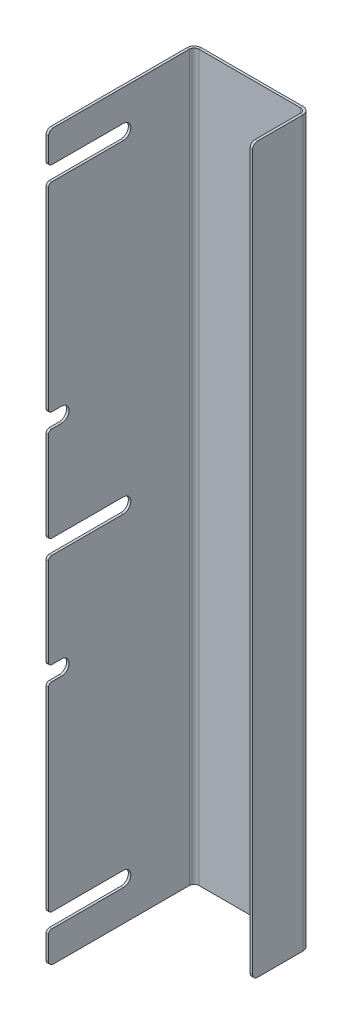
ISO-10303-21;
HEADER;
FILE_DESCRIPTION(('STEP AP214'),'2;1');
FILE_NAME('part.step','',(''),(''),'','','');
FILE_SCHEMA(('AUTOMOTIVE_DESIGN { 1 0 10303 214 1 1 1 1 }'));
ENDSEC;
DATA;
#1=APPLICATION_CONTEXT('core data for automotive mechanical design processes');
#2=APPLICATION_PROTOCOL_DEFINITION('international standard','automotive_design',2000,#1);
#3=PRODUCT_CONTEXT('',#1,'mechanical');
#4=PRODUCT('Part','Part','',(#3));
#5=PRODUCT_RELATED_PRODUCT_CATEGORY('part','',(#4));
#6=PRODUCT_DEFINITION_FORMATION('','',#4);
#7=PRODUCT_DEFINITION_CONTEXT('part definition',#1,'design');
#8=PRODUCT_DEFINITION('design','',#6,#7);
#9=PRODUCT_DEFINITION_SHAPE('','',#8);
#10=(LENGTH_UNIT() NAMED_UNIT(*) SI_UNIT(.MILLI.,.METRE.));
#11=(NAMED_UNIT(*) PLANE_ANGLE_UNIT() SI_UNIT($,.RADIAN.));
#12=(NAMED_UNIT(*) SI_UNIT($,.STERADIAN.) SOLID_ANGLE_UNIT());
#13=UNCERTAINTY_MEASURE_WITH_UNIT(LENGTH_MEASURE(1.E-05),#10,'distance_accuracy_value','');
#14=(GEOMETRIC_REPRESENTATION_CONTEXT(3) GLOBAL_UNCERTAINTY_ASSIGNED_CONTEXT((#13)) GLOBAL_UNIT_ASSIGNED_CONTEXT((#10,
#11,#12)) REPRESENTATION_CONTEXT('',''));
#15=CARTESIAN_POINT('',(0.,0.,0.));
#16=DIRECTION('',(0.,0.,1.));
#17=DIRECTION('',(1.,0.,0.));
#18=AXIS2_PLACEMENT_3D('',#15,#16,#17);
#19=CARTESIAN_POINT('',(-35.2500000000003,-220.,88.5));
#20=DIRECTION('',(0.,0.,1.));
#21=DIRECTION('',(1.,0.,0.));
#22=AXIS2_PLACEMENT_3D('',#19,#20,#21);
#23=PLANE('',#22);
#24=DIRECTION('',(0.,-1.,0.));
#25=VECTOR('',#24,1.);
#26=CARTESIAN_POINT('',(-35.2500000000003,-220.,88.5));
#27=LINE('',#26,#25);
#28=CARTESIAN_POINT('',(-35.2500000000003,217.,88.5));
#29=VERTEX_POINT('',#28);
#30=CARTESIAN_POINT('',(-35.2500000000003,203.,88.5));
#31=VERTEX_POINT('',#30);
#32=EDGE_CURVE('E515',#29,#31,#27,.T.);
#33=ORIENTED_EDGE('',*,*,#32,.T.);
#34=DIRECTION('',(-1.,0.,0.));
#35=VECTOR('',#34,1.);
#36=CARTESIAN_POINT('',(-33.7500000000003,203.,88.5));
#37=LINE('',#36,#35);
#38=CARTESIAN_POINT('',(-33.7500000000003,203.,88.5));
#39=VERTEX_POINT('',#38);
#40=EDGE_CURVE('E45',#31,#39,#37,.F.);
#41=ORIENTED_EDGE('',*,*,#40,.T.);
#42=DIRECTION('',(0.,-1.,0.));
#43=VECTOR('',#42,1.);
#44=CARTESIAN_POINT('',(-33.7500000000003,-220.,88.5));
#45=LINE('',#44,#43);
#46=CARTESIAN_POINT('',(-33.7500000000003,217.,88.5));
#47=VERTEX_POINT('',#46);
#48=EDGE_CURVE('E525',#47,#39,#45,.T.);
#49=ORIENTED_EDGE('',*,*,#48,.F.);
#50=DIRECTION('',(1.,0.,0.));
#51=VECTOR('',#50,1.);
#52=CARTESIAN_POINT('',(-35.2500000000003,217.,88.5));
#53=LINE('',#52,#51);
#54=EDGE_CURVE('E600',#47,#29,#53,.F.);
#55=ORIENTED_EDGE('',*,*,#54,.T.);
#56=EDGE_LOOP('',(#33,#41,#49,#55));
#57=FACE_BOUND('',#56,.T.);
#58=ADVANCED_FACE('F37',(#57),#23,.T.);
#59=CARTESIAN_POINT('',(-35.2500000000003,190.,88.5));
#60=VERTEX_POINT('',#59);
#61=CARTESIAN_POINT('',(-35.2500000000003,72.9999999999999,88.5));
#62=VERTEX_POINT('',#61);
#63=EDGE_CURVE('E519',#60,#62,#27,.T.);
#64=ORIENTED_EDGE('',*,*,#63,.T.);
#65=DIRECTION('',(-1.,0.,0.));
#66=VECTOR('',#65,1.);
#67=CARTESIAN_POINT('',(-33.7500000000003,72.9999999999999,88.5));
#68=LINE('',#67,#66);
#69=CARTESIAN_POINT('',(-33.7500000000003,72.9999999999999,88.5));
#70=VERTEX_POINT('',#69);
#71=EDGE_CURVE('E681',#62,#70,#68,.F.);
#72=ORIENTED_EDGE('',*,*,#71,.T.);
#73=CARTESIAN_POINT('',(-33.7500000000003,190.,88.5));
#74=VERTEX_POINT('',#73);
#75=EDGE_CURVE('E528',#74,#70,#45,.T.);
#76=ORIENTED_EDGE('',*,*,#75,.F.);
#77=DIRECTION('',(-1.,0.,0.));
#78=VECTOR('',#77,1.);
#79=CARTESIAN_POINT('',(-35.2500000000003,190.,88.5));
#80=LINE('',#79,#78);
#81=EDGE_CURVE('E678',#74,#60,#80,.T.);
#82=ORIENTED_EDGE('',*,*,#81,.T.);
#83=EDGE_LOOP('',(#64,#72,#76,#82));
#84=FACE_BOUND('',#83,.T.);
#85=ADVANCED_FACE('F708',(#84),#23,.T.);
#86=CARTESIAN_POINT('',(-35.2500000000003,59.9999999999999,88.5));
#87=VERTEX_POINT('',#86);
#88=CARTESIAN_POINT('',(-35.2500000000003,6.50000000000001,88.5));
#89=VERTEX_POINT('',#88);
#90=EDGE_CURVE('E749',#87,#89,#27,.T.);
#91=ORIENTED_EDGE('',*,*,#90,.T.);
#92=DIRECTION('',(-1.,0.,0.));
#93=VECTOR('',#92,1.);
#94=CARTESIAN_POINT('',(-33.7500000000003,6.50000000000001,88.5));
#95=LINE('',#94,#93);
#96=CARTESIAN_POINT('',(-33.7500000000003,6.50000000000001,88.5));
#97=VERTEX_POINT('',#96);
#98=EDGE_CURVE('E669',#89,#97,#95,.F.);
#99=ORIENTED_EDGE('',*,*,#98,.T.);
#100=CARTESIAN_POINT('',(-33.7500000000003,59.9999999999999,88.5));
#101=VERTEX_POINT('',#100);
#102=EDGE_CURVE('E710',#101,#97,#45,.T.);
#103=ORIENTED_EDGE('',*,*,#102,.F.);
#104=DIRECTION('',(-1.,0.,0.));
#105=VECTOR('',#104,1.);
#106=CARTESIAN_POINT('',(-35.2500000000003,59.9999999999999,88.5));
#107=LINE('',#106,#105);
#108=EDGE_CURVE('E666',#101,#87,#107,.T.);
#109=ORIENTED_EDGE('',*,*,#108,.T.);
#110=EDGE_LOOP('',(#91,#99,#103,#109));
#111=FACE_BOUND('',#110,.T.);
#112=ADVANCED_FACE('F846',(#111),#23,.T.);
#113=CARTESIAN_POINT('',(-35.2500000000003,-72.9999999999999,88.5));
#114=VERTEX_POINT('',#113);
#115=CARTESIAN_POINT('',(-35.2500000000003,-190.,88.5));
#116=VERTEX_POINT('',#115);
#117=EDGE_CURVE('E746',#114,#116,#27,.T.);
#118=ORIENTED_EDGE('',*,*,#117,.T.);
#119=DIRECTION('',(-1.,0.,0.));
#120=VECTOR('',#119,1.);
#121=CARTESIAN_POINT('',(-33.7500000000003,-190.,88.5));
#122=LINE('',#121,#120);
#123=CARTESIAN_POINT('',(-33.7500000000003,-190.,88.5));
#124=VERTEX_POINT('',#123);
#125=EDGE_CURVE('E628',#116,#124,#122,.F.);
#126=ORIENTED_EDGE('',*,*,#125,.T.);
#127=CARTESIAN_POINT('',(-33.7500000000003,-72.9999999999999,88.5));
#128=VERTEX_POINT('',#127);
#129=EDGE_CURVE('E530',#128,#124,#45,.T.);
#130=ORIENTED_EDGE('',*,*,#129,.F.);
#131=DIRECTION('',(-1.,0.,0.));
#132=VECTOR('',#131,1.);
#133=CARTESIAN_POINT('',(-35.2500000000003,-72.9999999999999,88.5));
#134=LINE('',#133,#132);
#135=EDGE_CURVE('E625',#128,#114,#134,.T.);
#136=ORIENTED_EDGE('',*,*,#135,.T.);
#137=EDGE_LOOP('',(#118,#126,#130,#136));
#138=FACE_BOUND('',#137,.T.);
#139=ADVANCED_FACE('F745',(#138),#23,.T.);
#140=CARTESIAN_POINT('',(-35.2500000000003,-6.50000000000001,88.5));
#141=VERTEX_POINT('',#140);
#142=CARTESIAN_POINT('',(-35.2500000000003,-59.9999999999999,88.5));
#143=VERTEX_POINT('',#142);
#144=EDGE_CURVE('E748',#141,#143,#27,.T.);
#145=ORIENTED_EDGE('',*,*,#144,.T.);
#146=DIRECTION('',(-1.,0.,0.));
#147=VECTOR('',#146,1.);
#148=CARTESIAN_POINT('',(-33.7500000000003,-59.9999999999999,88.5));
#149=LINE('',#148,#147);
#150=CARTESIAN_POINT('',(-33.7500000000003,-59.9999999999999,88.5));
#151=VERTEX_POINT('',#150);
#152=EDGE_CURVE('E661',#143,#151,#149,.F.);
#153=ORIENTED_EDGE('',*,*,#152,.T.);
#154=CARTESIAN_POINT('',(-33.7500000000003,-6.50000000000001,88.5));
#155=VERTEX_POINT('',#154);
#156=EDGE_CURVE('E529',#155,#151,#45,.T.);
#157=ORIENTED_EDGE('',*,*,#156,.F.);
#158=DIRECTION('',(-1.,0.,0.));
#159=VECTOR('',#158,1.);
#160=CARTESIAN_POINT('',(-35.2500000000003,-6.50000000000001,88.5));
#161=LINE('',#160,#159);
#162=EDGE_CURVE('E658',#155,#141,#161,.T.);
#163=ORIENTED_EDGE('',*,*,#162,.T.);
#164=EDGE_LOOP('',(#145,#153,#157,#163));
#165=FACE_BOUND('',#164,.T.);
#166=ADVANCED_FACE('F850',(#165),#23,.T.);
#167=CARTESIAN_POINT('',(0.,0.,-1.5));
#168=DIRECTION('',(0.,0.,1.));
#169=DIRECTION('',(1.,0.,0.));
#170=AXIS2_PLACEMENT_3D('',#167,#168,#169);
#171=PLANE('',#170);
#172=DIRECTION('',(0.,1.,0.));
#173=VECTOR('',#172,1.);
#174=CARTESIAN_POINT('',(30.85,220.,-1.50000000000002));
#175=LINE('',#174,#173);
#176=CARTESIAN_POINT('',(30.85,220.,-1.50000000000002));
#177=VERTEX_POINT('',#176);
#178=CARTESIAN_POINT('',(30.85,-220.,-1.5));
#179=VERTEX_POINT('',#178);
#180=EDGE_CURVE('E475',#177,#179,#175,.F.);
#181=ORIENTED_EDGE('',*,*,#180,.T.);
#182=DIRECTION('',(1.,0.,0.));
#183=VECTOR('',#182,1.);
#184=CARTESIAN_POINT('',(33.75,-220.,-1.5));
#185=LINE('',#184,#183);
#186=CARTESIAN_POINT('',(-30.85,-220.,-1.50000000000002));
#187=VERTEX_POINT('',#186);
#188=EDGE_CURVE('E556',#187,#179,#185,.T.);
#189=ORIENTED_EDGE('',*,*,#188,.F.);
#190=DIRECTION('',(0.,-1.,0.));
#191=VECTOR('',#190,1.);
#192=CARTESIAN_POINT('',(-30.85,-220.,-1.50000000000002));
#193=LINE('',#192,#191);
#194=CARTESIAN_POINT('',(-30.85,220.,-1.5));
#195=VERTEX_POINT('',#194);
#196=EDGE_CURVE('E532',#187,#195,#193,.F.);
#197=ORIENTED_EDGE('',*,*,#196,.T.);
#198=DIRECTION('',(-1.,0.,0.));
#199=VECTOR('',#198,1.);
#200=CARTESIAN_POINT('',(33.75,220.,-1.5));
#201=LINE('',#200,#199);
#202=EDGE_CURVE('E559',#177,#195,#201,.T.);
#203=ORIENTED_EDGE('',*,*,#202,.F.);
#204=EDGE_LOOP('',(#181,#189,#197,#203));
#205=FACE_BOUND('',#204,.T.);
#206=ADVANCED_FACE('F859',(#205),#171,.F.);
#207=CARTESIAN_POINT('',(0.,0.,0.));
#208=DIRECTION('',(0.,0.,1.));
#209=DIRECTION('',(1.,0.,0.));
#210=AXIS2_PLACEMENT_3D('',#207,#208,#209);
#211=PLANE('',#210);
#212=DIRECTION('',(1.,0.,0.));
#213=VECTOR('',#212,1.);
#214=CARTESIAN_POINT('',(33.75,-220.,0.));
#215=LINE('',#214,#213);
#216=CARTESIAN_POINT('',(-30.85,-220.,0.));
#217=VERTEX_POINT('',#216);
#218=CARTESIAN_POINT('',(30.85,-220.,0.));
#219=VERTEX_POINT('',#218);
#220=EDGE_CURVE('E553',#217,#219,#215,.T.);
#221=ORIENTED_EDGE('',*,*,#220,.T.);
#222=DIRECTION('',(0.,1.,0.));
#223=VECTOR('',#222,1.);
#224=CARTESIAN_POINT('',(30.85,220.,0.));
#225=LINE('',#224,#223);
#226=CARTESIAN_POINT('',(30.85,220.,0.));
#227=VERTEX_POINT('',#226);
#228=EDGE_CURVE('E487',#227,#219,#225,.F.);
#229=ORIENTED_EDGE('',*,*,#228,.F.);
#230=DIRECTION('',(-1.,0.,0.));
#231=VECTOR('',#230,1.);
#232=CARTESIAN_POINT('',(33.75,220.,0.));
#233=LINE('',#232,#231);
#234=CARTESIAN_POINT('',(-30.85,220.,0.));
#235=VERTEX_POINT('',#234);
#236=EDGE_CURVE('E560',#227,#235,#233,.T.);
#237=ORIENTED_EDGE('',*,*,#236,.T.);
#238=DIRECTION('',(0.,-1.,0.));
#239=VECTOR('',#238,1.);
#240=CARTESIAN_POINT('',(-30.85,-220.,0.));
#241=LINE('',#240,#239);
#242=EDGE_CURVE('E545',#217,#235,#241,.F.);
#243=ORIENTED_EDGE('',*,*,#242,.F.);
#244=EDGE_LOOP('',(#221,#229,#237,#243));
#245=FACE_BOUND('',#244,.T.);
#246=ADVANCED_FACE('F787',(#245),#211,.T.);
#247=CARTESIAN_POINT('',(33.75,220.,-1.5));
#248=DIRECTION('',(0.,1.,0.));
#249=DIRECTION('',(0.,0.,1.));
#250=AXIS2_PLACEMENT_3D('',#247,#248,#249);
#251=PLANE('',#250);
#252=ORIENTED_EDGE('',*,*,#236,.F.);
#253=DIRECTION('',(0.,0.,-1.));
#254=VECTOR('',#253,1.);
#255=CARTESIAN_POINT('',(30.85,220.,0.));
#256=LINE('',#255,#254);
#257=EDGE_CURVE('E481',#227,#177,#256,.T.);
#258=ORIENTED_EDGE('',*,*,#257,.T.);
#259=ORIENTED_EDGE('',*,*,#202,.T.);
#260=DIRECTION('',(0.,0.,-1.));
#261=VECTOR('',#260,1.);
#262=CARTESIAN_POINT('',(-30.85,220.,0.));
#263=LINE('',#262,#261);
#264=EDGE_CURVE('E550',#235,#195,#263,.T.);
#265=ORIENTED_EDGE('',*,*,#264,.F.);
#266=EDGE_LOOP('',(#252,#258,#259,#265));
#267=FACE_BOUND('',#266,.T.);
#268=ADVANCED_FACE('F1294',(#267),#251,.T.);
#269=CARTESIAN_POINT('',(33.75,-220.,-1.5));
#270=DIRECTION('',(0.,-1.,0.));
#271=DIRECTION('',(0.,0.,-1.));
#272=AXIS2_PLACEMENT_3D('',#269,#270,#271);
#273=PLANE('',#272);
#274=DIRECTION('',(0.,0.,-1.));
#275=VECTOR('',#274,1.);
#276=CARTESIAN_POINT('',(30.85,-220.,0.));
#277=LINE('',#276,#275);
#278=EDGE_CURVE('E492',#219,#179,#277,.T.);
#279=ORIENTED_EDGE('',*,*,#278,.F.);
#280=ORIENTED_EDGE('',*,*,#220,.F.);
#281=DIRECTION('',(0.,0.,-1.));
#282=VECTOR('',#281,1.);
#283=CARTESIAN_POINT('',(-30.85,-220.,0.));
#284=LINE('',#283,#282);
#285=EDGE_CURVE('E539',#217,#187,#284,.T.);
#286=ORIENTED_EDGE('',*,*,#285,.T.);
#287=ORIENTED_EDGE('',*,*,#188,.T.);
#288=EDGE_LOOP('',(#279,#280,#286,#287));
#289=FACE_BOUND('',#288,.T.);
#290=ADVANCED_FACE('F790',(#289),#273,.T.);
#291=CARTESIAN_POINT('',(-30.85,220.,2.90000000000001));
#292=DIRECTION('',(0.,1.,0.));
#293=DIRECTION('',(0.,0.,1.));
#294=AXIS2_PLACEMENT_3D('',#291,#292,#293);
#295=PLANE('',#294);
#296=DIRECTION('',(-1.,0.,0.));
#297=VECTOR('',#296,1.);
#298=CARTESIAN_POINT('',(-33.75,220.,2.89999999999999));
#299=LINE('',#298,#297);
#300=CARTESIAN_POINT('',(-33.75,220.,2.9));
#301=VERTEX_POINT('',#300);
#302=CARTESIAN_POINT('',(-35.25,220.,2.89999999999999));
#303=VERTEX_POINT('',#302);
#304=EDGE_CURVE('E495',#301,#303,#299,.T.);
#305=ORIENTED_EDGE('',*,*,#304,.F.);
#306=CARTESIAN_POINT('',(-30.85,220.,2.90000000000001));
#307=DIRECTION('',(0.,-1.,0.));
#308=DIRECTION('',(0.,0.,-1.));
#309=AXIS2_PLACEMENT_3D('',#306,#307,#308);
#310=CIRCLE('',#309,2.9);
#311=EDGE_CURVE('E542',#235,#301,#310,.F.);
#312=ORIENTED_EDGE('',*,*,#311,.F.);
#313=ORIENTED_EDGE('',*,*,#264,.T.);
#314=CARTESIAN_POINT('',(-30.85,220.,2.90000000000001));
#315=DIRECTION('',(0.,-1.,0.));
#316=DIRECTION('',(0.,0.,-1.));
#317=AXIS2_PLACEMENT_3D('',#314,#315,#316);
#318=CIRCLE('',#317,4.4);
#319=EDGE_CURVE('E535',#195,#303,#318,.F.);
#320=ORIENTED_EDGE('',*,*,#319,.T.);
#321=EDGE_LOOP('',(#305,#312,#313,#320));
#322=FACE_BOUND('',#321,.T.);
#323=ADVANCED_FACE('F776',(#322),#295,.T.);
#324=CARTESIAN_POINT('',(-30.85,-220.,2.89999999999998));
#325=DIRECTION('',(0.,1.,0.));
#326=DIRECTION('',(0.,0.,1.));
#327=AXIS2_PLACEMENT_3D('',#324,#325,#326);
#328=PLANE('',#327);
#329=CARTESIAN_POINT('',(-30.85,-220.,2.89999999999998));
#330=DIRECTION('',(0.,-1.,0.));
#331=DIRECTION('',(0.,0.,-1.));
#332=AXIS2_PLACEMENT_3D('',#329,#330,#331);
#333=CIRCLE('',#332,2.9);
#334=CARTESIAN_POINT('',(-33.75,-220.,2.89999999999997));
#335=VERTEX_POINT('',#334);
#336=EDGE_CURVE('E521',#335,#217,#333,.T.);
#337=ORIENTED_EDGE('',*,*,#336,.F.);
#338=DIRECTION('',(-1.,0.,0.));
#339=VECTOR('',#338,1.);
#340=CARTESIAN_POINT('',(-33.75,-220.,2.89999999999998));
#341=LINE('',#340,#339);
#342=CARTESIAN_POINT('',(-35.25,-220.,2.89999999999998));
#343=VERTEX_POINT('',#342);
#344=EDGE_CURVE('E501',#335,#343,#341,.T.);
#345=ORIENTED_EDGE('',*,*,#344,.T.);
#346=CARTESIAN_POINT('',(-30.85,-220.,2.89999999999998));
#347=DIRECTION('',(0.,-1.,0.));
#348=DIRECTION('',(0.,0.,-1.));
#349=AXIS2_PLACEMENT_3D('',#346,#347,#348);
#350=CIRCLE('',#349,4.4);
#351=EDGE_CURVE('E536',#343,#187,#350,.T.);
#352=ORIENTED_EDGE('',*,*,#351,.T.);
#353=ORIENTED_EDGE('',*,*,#285,.F.);
#354=EDGE_LOOP('',(#337,#345,#352,#353));
#355=FACE_BOUND('',#354,.T.);
#356=ADVANCED_FACE('F768',(#355),#328,.F.);
#357=CARTESIAN_POINT('',(-30.85,-220.,2.89999999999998));
#358=DIRECTION('',(0.,-1.,0.));
#359=DIRECTION('',(-1.,0.,0.));
#360=AXIS2_PLACEMENT_3D('',#357,#358,#359);
#361=CYLINDRICAL_SURFACE('',#360,4.4);
#362=ORIENTED_EDGE('',*,*,#196,.F.);
#363=ORIENTED_EDGE('',*,*,#351,.F.);
#364=DIRECTION('',(0.,-1.,0.));
#365=VECTOR('',#364,1.);
#366=CARTESIAN_POINT('',(-35.25,0.,2.89999999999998));
#367=LINE('',#366,#365);
#368=EDGE_CURVE('E504',#303,#343,#367,.T.);
#369=ORIENTED_EDGE('',*,*,#368,.F.);
#370=ORIENTED_EDGE('',*,*,#319,.F.);
#371=EDGE_LOOP('',(#362,#363,#369,#370));
#372=FACE_BOUND('',#371,.T.);
#373=ADVANCED_FACE('F774',(#372),#361,.T.);
#374=CARTESIAN_POINT('',(-30.85,-220.,2.89999999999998));
#375=DIRECTION('',(0.,-1.,0.));
#376=DIRECTION('',(-1.,0.,0.));
#377=AXIS2_PLACEMENT_3D('',#374,#375,#376);
#378=CYLINDRICAL_SURFACE('',#377,2.9);
#379=ORIENTED_EDGE('',*,*,#242,.T.);
#380=ORIENTED_EDGE('',*,*,#311,.T.);
#381=DIRECTION('',(0.,-1.,0.));
#382=VECTOR('',#381,1.);
#383=CARTESIAN_POINT('',(-33.75,220.,2.89999999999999));
#384=LINE('',#383,#382);
#385=EDGE_CURVE('E498',#301,#335,#384,.T.);
#386=ORIENTED_EDGE('',*,*,#385,.T.);
#387=ORIENTED_EDGE('',*,*,#336,.T.);
#388=EDGE_LOOP('',(#379,#380,#386,#387));
#389=FACE_BOUND('',#388,.T.);
#390=ADVANCED_FACE('F784',(#389),#378,.F.);
#391=CARTESIAN_POINT('',(-35.25,-220.,0.));
#392=DIRECTION('',(0.,-1.,0.));
#393=DIRECTION('',(0.,0.,-1.));
#394=AXIS2_PLACEMENT_3D('',#391,#392,#393);
#395=PLANE('',#394);
#396=DIRECTION('',(0.,0.,-1.));
#397=VECTOR('',#396,1.);
#398=CARTESIAN_POINT('',(-33.75,-220.,0.));
#399=LINE('',#398,#397);
#400=CARTESIAN_POINT('',(-33.7500000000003,-220.,85.5));
#401=VERTEX_POINT('',#400);
#402=EDGE_CURVE('E514',#401,#335,#399,.T.);
#403=ORIENTED_EDGE('',*,*,#402,.F.);
#404=DIRECTION('',(1.,0.,0.));
#405=VECTOR('',#404,1.);
#406=CARTESIAN_POINT('',(-35.2500000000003,-220.,85.5));
#407=LINE('',#406,#405);
#408=CARTESIAN_POINT('',(-35.2500000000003,-220.,85.5));
#409=VERTEX_POINT('',#408);
#410=EDGE_CURVE('E590',#401,#409,#407,.F.);
#411=ORIENTED_EDGE('',*,*,#410,.T.);
#412=DIRECTION('',(0.,0.,-1.));
#413=VECTOR('',#412,1.);
#414=CARTESIAN_POINT('',(-35.25,-220.,0.));
#415=LINE('',#414,#413);
#416=EDGE_CURVE('E518',#409,#343,#415,.T.);
#417=ORIENTED_EDGE('',*,*,#416,.T.);
#418=ORIENTED_EDGE('',*,*,#344,.F.);
#419=EDGE_LOOP('',(#403,#411,#417,#418));
#420=FACE_BOUND('',#419,.T.);
#421=ADVANCED_FACE('F764',(#420),#395,.T.);
#422=CARTESIAN_POINT('',(-35.2500000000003,220.,88.5));
#423=DIRECTION('',(0.,1.,0.));
#424=DIRECTION('',(0.,0.,1.));
#425=AXIS2_PLACEMENT_3D('',#422,#423,#424);
#426=PLANE('',#425);
#427=DIRECTION('',(0.,0.,1.));
#428=VECTOR('',#427,1.);
#429=CARTESIAN_POINT('',(-35.2500000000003,220.,88.5));
#430=LINE('',#429,#428);
#431=CARTESIAN_POINT('',(-35.2500000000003,220.,85.5));
#432=VERTEX_POINT('',#431);
#433=EDGE_CURVE('E510',#303,#432,#430,.T.);
#434=ORIENTED_EDGE('',*,*,#433,.T.);
#435=DIRECTION('',(1.,0.,0.));
#436=VECTOR('',#435,1.);
#437=CARTESIAN_POINT('',(-35.2500000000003,220.,85.5));
#438=LINE('',#437,#436);
#439=CARTESIAN_POINT('',(-33.7500000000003,220.,85.5));
#440=VERTEX_POINT('',#439);
#441=EDGE_CURVE('E597',#432,#440,#438,.T.);
#442=ORIENTED_EDGE('',*,*,#441,.T.);
#443=DIRECTION('',(0.,0.,1.));
#444=VECTOR('',#443,1.);
#445=CARTESIAN_POINT('',(-33.7500000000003,220.,88.5));
#446=LINE('',#445,#444);
#447=EDGE_CURVE('E509',#301,#440,#446,.T.);
#448=ORIENTED_EDGE('',*,*,#447,.F.);
#449=ORIENTED_EDGE('',*,*,#304,.T.);
#450=EDGE_LOOP('',(#434,#442,#448,#449));
#451=FACE_BOUND('',#450,.T.);
#452=ADVANCED_FACE('F781',(#451),#426,.T.);
#453=CARTESIAN_POINT('',(-35.25,0.,-1.24315697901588E-13));
#454=DIRECTION('',(-1.,0.,0.));
#455=DIRECTION('',(0.,0.,1.));
#456=AXIS2_PLACEMENT_3D('',#453,#454,#455);
#457=PLANE('',#456);
#458=DIRECTION('',(0.,0.,-1.));
#459=VECTOR('',#458,1.);
#460=CARTESIAN_POINT('',(-35.2500000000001,-192.,42.9999999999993));
#461=LINE('',#460,#459);
#462=CARTESIAN_POINT('',(-35.2500000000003,-192.,86.5));
#463=VERTEX_POINT('',#462);
#464=CARTESIAN_POINT('',(-35.2500000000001,-192.,42.9999999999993));
#465=VERTEX_POINT('',#464);
#466=EDGE_CURVE('E439',#463,#465,#461,.T.);
#467=ORIENTED_EDGE('',*,*,#466,.F.);
#468=CARTESIAN_POINT('',(-35.2500000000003,-190.,86.5));
#469=DIRECTION('',(-1.,0.,0.));
#470=DIRECTION('',(0.,0.,1.));
#471=AXIS2_PLACEMENT_3D('',#468,#469,#470);
#472=CIRCLE('',#471,2.);
#473=EDGE_CURVE('E623',#463,#116,#472,.T.);
#474=ORIENTED_EDGE('',*,*,#473,.T.);
#475=ORIENTED_EDGE('',*,*,#117,.F.);
#476=CARTESIAN_POINT('',(-35.2500000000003,-72.9999999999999,86.5));
#477=DIRECTION('',(-1.,0.,0.));
#478=DIRECTION('',(0.,0.,1.));
#479=AXIS2_PLACEMENT_3D('',#476,#477,#478);
#480=CIRCLE('',#479,2.);
#481=CARTESIAN_POINT('',(-35.2500000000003,-70.9999999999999,86.5));
#482=VERTEX_POINT('',#481);
#483=EDGE_CURVE('E619',#114,#482,#480,.T.);
#484=ORIENTED_EDGE('',*,*,#483,.T.);
#485=DIRECTION('',(0.,0.,1.));
#486=VECTOR('',#485,1.);
#487=CARTESIAN_POINT('',(-35.2500000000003,-70.9999999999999,80.4999999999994));
#488=LINE('',#487,#486);
#489=CARTESIAN_POINT('',(-35.2500000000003,-70.9999999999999,80.4999999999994));
#490=VERTEX_POINT('',#489);
#491=EDGE_CURVE('E420',#490,#482,#488,.T.);
#492=ORIENTED_EDGE('',*,*,#491,.F.);
#493=CARTESIAN_POINT('',(-35.2500000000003,-66.4999999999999,80.4999999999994));
#494=DIRECTION('',(-1.,0.,0.));
#495=DIRECTION('',(0.,0.,-1.));
#496=AXIS2_PLACEMENT_3D('',#493,#494,#495);
#497=CIRCLE('',#496,4.5);
#498=CARTESIAN_POINT('',(-35.2500000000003,-61.9999999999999,80.4999999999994));
#499=VERTEX_POINT('',#498);
#500=EDGE_CURVE('E414',#499,#490,#497,.T.);
#501=ORIENTED_EDGE('',*,*,#500,.F.);
#502=DIRECTION('',(0.,0.,-1.));
#503=VECTOR('',#502,1.);
#504=CARTESIAN_POINT('',(-35.2500000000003,-61.9999999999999,88.5));
#505=LINE('',#504,#503);
#506=CARTESIAN_POINT('',(-35.2500000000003,-61.9999999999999,86.5));
#507=VERTEX_POINT('',#506);
#508=EDGE_CURVE('E422',#507,#499,#505,.T.);
#509=ORIENTED_EDGE('',*,*,#508,.F.);
#510=CARTESIAN_POINT('',(-35.2500000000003,-59.9999999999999,86.5));
#511=DIRECTION('',(-1.,0.,0.));
#512=DIRECTION('',(0.,0.,1.));
#513=AXIS2_PLACEMENT_3D('',#510,#511,#512);
#514=CIRCLE('',#513,2.);
#515=EDGE_CURVE('E617',#507,#143,#514,.T.);
#516=ORIENTED_EDGE('',*,*,#515,.T.);
#517=ORIENTED_EDGE('',*,*,#144,.F.);
#518=CARTESIAN_POINT('',(-35.2500000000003,-6.50000000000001,86.5));
#519=DIRECTION('',(-1.,0.,0.));
#520=DIRECTION('',(0.,0.,1.));
#521=AXIS2_PLACEMENT_3D('',#518,#519,#520);
#522=CIRCLE('',#521,2.);
#523=CARTESIAN_POINT('',(-35.2500000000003,-4.50000000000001,86.5));
#524=VERTEX_POINT('',#523);
#525=EDGE_CURVE('E613',#141,#524,#522,.T.);
#526=ORIENTED_EDGE('',*,*,#525,.T.);
#527=DIRECTION('',(0.,0.,1.));
#528=VECTOR('',#527,1.);
#529=CARTESIAN_POINT('',(-35.2500000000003,-4.50000000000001,88.5));
#530=LINE('',#529,#528);
#531=CARTESIAN_POINT('',(-35.2500000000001,-4.50000000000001,42.9999999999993));
#532=VERTEX_POINT('',#531);
#533=EDGE_CURVE('E403',#532,#524,#530,.T.);
#534=ORIENTED_EDGE('',*,*,#533,.F.);
#535=CARTESIAN_POINT('',(-35.2500000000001,0.,42.9999999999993));
#536=DIRECTION('',(-1.,0.,0.));
#537=DIRECTION('',(0.,0.,1.));
#538=AXIS2_PLACEMENT_3D('',#535,#536,#537);
#539=CIRCLE('',#538,4.50000000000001);
#540=CARTESIAN_POINT('',(-35.2500000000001,4.50000000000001,42.9999999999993));
#541=VERTEX_POINT('',#540);
#542=EDGE_CURVE('E400',#541,#532,#539,.T.);
#543=ORIENTED_EDGE('',*,*,#542,.F.);
#544=DIRECTION('',(0.,0.,-1.));
#545=VECTOR('',#544,1.);
#546=CARTESIAN_POINT('',(-35.2500000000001,4.50000000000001,42.9999999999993));
#547=LINE('',#546,#545);
#548=CARTESIAN_POINT('',(-35.2500000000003,4.50000000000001,86.5));
#549=VERTEX_POINT('',#548);
#550=EDGE_CURVE('E394',#549,#541,#547,.T.);
#551=ORIENTED_EDGE('',*,*,#550,.F.);
#552=CARTESIAN_POINT('',(-35.2500000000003,6.50000000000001,86.5));
#553=DIRECTION('',(-1.,0.,0.));
#554=DIRECTION('',(0.,0.,1.));
#555=AXIS2_PLACEMENT_3D('',#552,#553,#554);
#556=CIRCLE('',#555,2.);
#557=EDGE_CURVE('E615',#549,#89,#556,.T.);
#558=ORIENTED_EDGE('',*,*,#557,.T.);
#559=ORIENTED_EDGE('',*,*,#90,.F.);
#560=CARTESIAN_POINT('',(-35.2500000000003,59.9999999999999,86.5));
#561=DIRECTION('',(-1.,0.,0.));
#562=DIRECTION('',(0.,0.,1.));
#563=AXIS2_PLACEMENT_3D('',#560,#561,#562);
#564=CIRCLE('',#563,2.);
#565=CARTESIAN_POINT('',(-35.2500000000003,61.9999999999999,86.5));
#566=VERTEX_POINT('',#565);
#567=EDGE_CURVE('E611',#87,#566,#564,.T.);
#568=ORIENTED_EDGE('',*,*,#567,.T.);
#569=DIRECTION('',(0.,0.,1.));
#570=VECTOR('',#569,1.);
#571=CARTESIAN_POINT('',(-35.2500000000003,61.9999999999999,88.5));
#572=LINE('',#571,#570);
#573=CARTESIAN_POINT('',(-35.2500000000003,61.9999999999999,80.4999999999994));
#574=VERTEX_POINT('',#573);
#575=EDGE_CURVE('E382',#574,#566,#572,.T.);
#576=ORIENTED_EDGE('',*,*,#575,.F.);
#577=CARTESIAN_POINT('',(-35.2500000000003,66.4999999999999,80.4999999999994));
#578=DIRECTION('',(-1.,0.,0.));
#579=DIRECTION('',(0.,0.,1.));
#580=AXIS2_PLACEMENT_3D('',#577,#578,#579);
#581=CIRCLE('',#580,4.5);
#582=CARTESIAN_POINT('',(-35.2500000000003,70.9999999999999,80.4999999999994));
#583=VERTEX_POINT('',#582);
#584=EDGE_CURVE('E379',#583,#574,#581,.T.);
#585=ORIENTED_EDGE('',*,*,#584,.F.);
#586=DIRECTION('',(0.,0.,-1.));
#587=VECTOR('',#586,1.);
#588=CARTESIAN_POINT('',(-35.2500000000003,70.9999999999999,80.4999999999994));
#589=LINE('',#588,#587);
#590=CARTESIAN_POINT('',(-35.2500000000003,70.9999999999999,86.5));
#591=VERTEX_POINT('',#590);
#592=EDGE_CURVE('E373',#591,#583,#589,.T.);
#593=ORIENTED_EDGE('',*,*,#592,.F.);
#594=CARTESIAN_POINT('',(-35.2500000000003,72.9999999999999,86.5));
#595=DIRECTION('',(-1.,0.,0.));
#596=DIRECTION('',(0.,0.,1.));
#597=AXIS2_PLACEMENT_3D('',#594,#595,#596);
#598=CIRCLE('',#597,2.);
#599=EDGE_CURVE('E609',#591,#62,#598,.T.);
#600=ORIENTED_EDGE('',*,*,#599,.T.);
#601=ORIENTED_EDGE('',*,*,#63,.F.);
#602=CARTESIAN_POINT('',(-35.2500000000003,190.,86.5));
#603=DIRECTION('',(-1.,0.,0.));
#604=DIRECTION('',(0.,0.,1.));
#605=AXIS2_PLACEMENT_3D('',#602,#603,#604);
#606=CIRCLE('',#605,2.);
#607=CARTESIAN_POINT('',(-35.2500000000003,192.,86.5));
#608=VERTEX_POINT('',#607);
#609=EDGE_CURVE('E605',#60,#608,#606,.T.);
#610=ORIENTED_EDGE('',*,*,#609,.T.);
#611=DIRECTION('',(0.,0.,1.));
#612=VECTOR('',#611,1.);
#613=CARTESIAN_POINT('',(-35.2500000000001,192.,42.9999999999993));
#614=LINE('',#613,#612);
#615=CARTESIAN_POINT('',(-35.2500000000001,192.,42.9999999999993));
#616=VERTEX_POINT('',#615);
#617=EDGE_CURVE('E360',#616,#608,#614,.T.);
#618=ORIENTED_EDGE('',*,*,#617,.F.);
#619=CARTESIAN_POINT('',(-35.2500000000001,196.5,42.9999999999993));
#620=DIRECTION('',(-1.,0.,0.));
#621=DIRECTION('',(0.,0.,1.));
#622=AXIS2_PLACEMENT_3D('',#619,#620,#621);
#623=CIRCLE('',#622,4.5);
#624=CARTESIAN_POINT('',(-35.2500000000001,201.,42.9999999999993));
#625=VERTEX_POINT('',#624);
#626=EDGE_CURVE('E340',#625,#616,#623,.T.);
#627=ORIENTED_EDGE('',*,*,#626,.F.);
#628=DIRECTION('',(0.,0.,-1.));
#629=VECTOR('',#628,1.);
#630=CARTESIAN_POINT('',(-35.2500000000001,201.,42.9999999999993));
#631=LINE('',#630,#629);
#632=CARTESIAN_POINT('',(-35.2500000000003,201.,86.5));
#633=VERTEX_POINT('',#632);
#634=EDGE_CURVE('E358',#633,#625,#631,.T.);
#635=ORIENTED_EDGE('',*,*,#634,.F.);
#636=CARTESIAN_POINT('',(-35.2500000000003,203.,86.5));
#637=DIRECTION('',(-1.,0.,0.));
#638=DIRECTION('',(0.,0.,1.));
#639=AXIS2_PLACEMENT_3D('',#636,#637,#638);
#640=CIRCLE('',#639,2.);
#641=EDGE_CURVE('E607',#633,#31,#640,.T.);
#642=ORIENTED_EDGE('',*,*,#641,.T.);
#643=ORIENTED_EDGE('',*,*,#32,.F.);
#644=CARTESIAN_POINT('',(-35.2500000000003,217.,85.5));
#645=DIRECTION('',(-1.,0.,0.));
#646=DIRECTION('',(0.,0.,1.));
#647=AXIS2_PLACEMENT_3D('',#644,#645,#646);
#648=CIRCLE('',#647,3.);
#649=EDGE_CURVE('E592',#29,#432,#648,.T.);
#650=ORIENTED_EDGE('',*,*,#649,.T.);
#651=ORIENTED_EDGE('',*,*,#433,.F.);
#652=ORIENTED_EDGE('',*,*,#368,.T.);
#653=ORIENTED_EDGE('',*,*,#416,.F.);
#654=CARTESIAN_POINT('',(-35.2500000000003,-217.,85.5));
#655=DIRECTION('',(-1.,0.,0.));
#656=DIRECTION('',(0.,0.,1.));
#657=AXIS2_PLACEMENT_3D('',#654,#655,#656);
#658=CIRCLE('',#657,3.);
#659=CARTESIAN_POINT('',(-35.2500000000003,-217.,88.5));
#660=VERTEX_POINT('',#659);
#661=EDGE_CURVE('E594',#409,#660,#658,.T.);
#662=ORIENTED_EDGE('',*,*,#661,.T.);
#663=CARTESIAN_POINT('',(-35.2500000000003,-203.,88.5));
#664=VERTEX_POINT('',#663);
#665=EDGE_CURVE('E513',#664,#660,#27,.T.);
#666=ORIENTED_EDGE('',*,*,#665,.F.);
#667=CARTESIAN_POINT('',(-35.2500000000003,-203.,86.5));
#668=DIRECTION('',(-1.,0.,0.));
#669=DIRECTION('',(0.,0.,1.));
#670=AXIS2_PLACEMENT_3D('',#667,#668,#669);
#671=CIRCLE('',#670,2.);
#672=CARTESIAN_POINT('',(-35.2500000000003,-201.,86.5));
#673=VERTEX_POINT('',#672);
#674=EDGE_CURVE('E621',#664,#673,#671,.T.);
#675=ORIENTED_EDGE('',*,*,#674,.T.);
#676=DIRECTION('',(0.,0.,1.));
#677=VECTOR('',#676,1.);
#678=CARTESIAN_POINT('',(-35.2500000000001,-201.,42.9999999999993));
#679=LINE('',#678,#677);
#680=CARTESIAN_POINT('',(-35.2500000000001,-201.,42.9999999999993));
#681=VERTEX_POINT('',#680);
#682=EDGE_CURVE('E433',#681,#673,#679,.T.);
#683=ORIENTED_EDGE('',*,*,#682,.F.);
#684=CARTESIAN_POINT('',(-35.2500000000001,-196.5,42.9999999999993));
#685=DIRECTION('',(-1.,0.,0.));
#686=DIRECTION('',(0.,0.,-1.));
#687=AXIS2_PLACEMENT_3D('',#684,#685,#686);
#688=CIRCLE('',#687,4.5);
#689=EDGE_CURVE('E441',#465,#681,#688,.T.);
#690=ORIENTED_EDGE('',*,*,#689,.F.);
#691=EDGE_LOOP('',(#467,#474,#475,#484,#492,#501,#509,#516,#517,#526,#534,#543,#551,#558,#559,
#568,#576,#585,#593,#600,#601,#610,#618,#627,#635,#642,#643,#650,#651,#652,#653,#662,#666,#675,
#683,#690));
#692=FACE_BOUND('',#691,.T.);
#693=ADVANCED_FACE('F699',(#692),#457,.T.);
#694=CARTESIAN_POINT('',(-33.75,0.,-1.19078475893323E-13));
#695=DIRECTION('',(-1.,0.,0.));
#696=DIRECTION('',(0.,0.,1.));
#697=AXIS2_PLACEMENT_3D('',#694,#695,#696);
#698=PLANE('',#697);
#699=ORIENTED_EDGE('',*,*,#129,.T.);
#700=CARTESIAN_POINT('',(-33.7500000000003,-190.,86.5));
#701=DIRECTION('',(-1.,0.,0.));
#702=DIRECTION('',(0.,0.,1.));
#703=AXIS2_PLACEMENT_3D('',#700,#701,#702);
#704=CIRCLE('',#703,2.);
#705=CARTESIAN_POINT('',(-33.7500000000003,-192.,86.5));
#706=VERTEX_POINT('',#705);
#707=EDGE_CURVE('E648',#124,#706,#704,.F.);
#708=ORIENTED_EDGE('',*,*,#707,.T.);
#709=DIRECTION('',(0.,0.,-1.));
#710=VECTOR('',#709,1.);
#711=CARTESIAN_POINT('',(-33.7500000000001,-192.,42.9999999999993));
#712=LINE('',#711,#710);
#713=CARTESIAN_POINT('',(-33.7500000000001,-192.,42.9999999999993));
#714=VERTEX_POINT('',#713);
#715=EDGE_CURVE('E430',#706,#714,#712,.T.);
#716=ORIENTED_EDGE('',*,*,#715,.T.);
#717=CARTESIAN_POINT('',(-33.7500000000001,-196.5,42.9999999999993));
#718=DIRECTION('',(-1.,0.,0.));
#719=DIRECTION('',(0.,0.,-1.));
#720=AXIS2_PLACEMENT_3D('',#717,#718,#719);
#721=CIRCLE('',#720,4.5);
#722=CARTESIAN_POINT('',(-33.7500000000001,-201.,42.9999999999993));
#723=VERTEX_POINT('',#722);
#724=EDGE_CURVE('E432',#714,#723,#721,.T.);
#725=ORIENTED_EDGE('',*,*,#724,.T.);
#726=DIRECTION('',(0.,0.,1.));
#727=VECTOR('',#726,1.);
#728=CARTESIAN_POINT('',(-33.7500000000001,-201.,42.9999999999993));
#729=LINE('',#728,#727);
#730=CARTESIAN_POINT('',(-33.7500000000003,-201.,86.5));
#731=VERTEX_POINT('',#730);
#732=EDGE_CURVE('E436',#723,#731,#729,.T.);
#733=ORIENTED_EDGE('',*,*,#732,.T.);
#734=CARTESIAN_POINT('',(-33.7500000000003,-203.,86.5));
#735=DIRECTION('',(-1.,0.,0.));
#736=DIRECTION('',(0.,0.,1.));
#737=AXIS2_PLACEMENT_3D('',#734,#735,#736);
#738=CIRCLE('',#737,2.);
#739=CARTESIAN_POINT('',(-33.7500000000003,-203.,88.5));
#740=VERTEX_POINT('',#739);
#741=EDGE_CURVE('E646',#731,#740,#738,.F.);
#742=ORIENTED_EDGE('',*,*,#741,.T.);
#743=CARTESIAN_POINT('',(-33.7500000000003,-217.,88.5));
#744=VERTEX_POINT('',#743);
#745=EDGE_CURVE('E524',#740,#744,#45,.T.);
#746=ORIENTED_EDGE('',*,*,#745,.T.);
#747=CARTESIAN_POINT('',(-33.7500000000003,-217.,85.5));
#748=DIRECTION('',(-1.,0.,0.));
#749=DIRECTION('',(0.,0.,1.));
#750=AXIS2_PLACEMENT_3D('',#747,#748,#749);
#751=CIRCLE('',#750,3.);
#752=EDGE_CURVE('E588',#744,#401,#751,.F.);
#753=ORIENTED_EDGE('',*,*,#752,.T.);
#754=ORIENTED_EDGE('',*,*,#402,.T.);
#755=ORIENTED_EDGE('',*,*,#385,.F.);
#756=ORIENTED_EDGE('',*,*,#447,.T.);
#757=CARTESIAN_POINT('',(-33.7500000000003,217.,85.5));
#758=DIRECTION('',(-1.,0.,0.));
#759=DIRECTION('',(0.,0.,1.));
#760=AXIS2_PLACEMENT_3D('',#757,#758,#759);
#761=CIRCLE('',#760,3.);
#762=EDGE_CURVE('E586',#440,#47,#761,.F.);
#763=ORIENTED_EDGE('',*,*,#762,.T.);
#764=ORIENTED_EDGE('',*,*,#48,.T.);
#765=CARTESIAN_POINT('',(-33.7500000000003,203.,86.5));
#766=DIRECTION('',(-1.,0.,0.));
#767=DIRECTION('',(0.,0.,1.));
#768=AXIS2_PLACEMENT_3D('',#765,#766,#767);
#769=CIRCLE('',#768,2.);
#770=CARTESIAN_POINT('',(-33.7500000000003,201.,86.5));
#771=VERTEX_POINT('',#770);
#772=EDGE_CURVE('E632',#39,#771,#769,.F.);
#773=ORIENTED_EDGE('',*,*,#772,.T.);
#774=DIRECTION('',(0.,0.,-1.));
#775=VECTOR('',#774,1.);
#776=CARTESIAN_POINT('',(-33.7500000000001,201.,42.9999999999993));
#777=LINE('',#776,#775);
#778=CARTESIAN_POINT('',(-33.7500000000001,201.,42.9999999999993));
#779=VERTEX_POINT('',#778);
#780=EDGE_CURVE('E345',#771,#779,#777,.T.);
#781=ORIENTED_EDGE('',*,*,#780,.T.);
#782=CARTESIAN_POINT('',(-33.7500000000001,196.5,42.9999999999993));
#783=DIRECTION('',(-1.,0.,0.));
#784=DIRECTION('',(0.,0.,1.));
#785=AXIS2_PLACEMENT_3D('',#782,#783,#784);
#786=CIRCLE('',#785,4.5);
#787=CARTESIAN_POINT('',(-33.7500000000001,192.,42.9999999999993));
#788=VERTEX_POINT('',#787);
#789=EDGE_CURVE('E338',#779,#788,#786,.T.);
#790=ORIENTED_EDGE('',*,*,#789,.T.);
#791=DIRECTION('',(0.,0.,1.));
#792=VECTOR('',#791,1.);
#793=CARTESIAN_POINT('',(-33.7500000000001,192.,42.9999999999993));
#794=LINE('',#793,#792);
#795=CARTESIAN_POINT('',(-33.7500000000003,192.,86.5));
#796=VERTEX_POINT('',#795);
#797=EDGE_CURVE('E348',#788,#796,#794,.T.);
#798=ORIENTED_EDGE('',*,*,#797,.T.);
#799=CARTESIAN_POINT('',(-33.7500000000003,190.,86.5));
#800=DIRECTION('',(-1.,0.,0.));
#801=DIRECTION('',(0.,0.,1.));
#802=AXIS2_PLACEMENT_3D('',#799,#800,#801);
#803=CIRCLE('',#802,2.);
#804=EDGE_CURVE('E630',#796,#74,#803,.F.);
#805=ORIENTED_EDGE('',*,*,#804,.T.);
#806=ORIENTED_EDGE('',*,*,#75,.T.);
#807=CARTESIAN_POINT('',(-33.7500000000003,72.9999999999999,86.5));
#808=DIRECTION('',(-1.,0.,0.));
#809=DIRECTION('',(0.,0.,1.));
#810=AXIS2_PLACEMENT_3D('',#807,#808,#809);
#811=CIRCLE('',#810,2.);
#812=CARTESIAN_POINT('',(-33.7500000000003,70.9999999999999,86.5));
#813=VERTEX_POINT('',#812);
#814=EDGE_CURVE('E634',#70,#813,#811,.F.);
#815=ORIENTED_EDGE('',*,*,#814,.T.);
#816=DIRECTION('',(0.,0.,-1.));
#817=VECTOR('',#816,1.);
#818=CARTESIAN_POINT('',(-33.7500000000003,70.9999999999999,80.4999999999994));
#819=LINE('',#818,#817);
#820=CARTESIAN_POINT('',(-33.7500000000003,70.9999999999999,80.4999999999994));
#821=VERTEX_POINT('',#820);
#822=EDGE_CURVE('E376',#813,#821,#819,.T.);
#823=ORIENTED_EDGE('',*,*,#822,.T.);
#824=CARTESIAN_POINT('',(-33.7500000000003,66.4999999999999,80.4999999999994));
#825=DIRECTION('',(-1.,0.,0.));
#826=DIRECTION('',(0.,0.,1.));
#827=AXIS2_PLACEMENT_3D('',#824,#825,#826);
#828=CIRCLE('',#827,4.5);
#829=CARTESIAN_POINT('',(-33.7500000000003,61.9999999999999,80.4999999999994));
#830=VERTEX_POINT('',#829);
#831=EDGE_CURVE('E369',#821,#830,#828,.T.);
#832=ORIENTED_EDGE('',*,*,#831,.T.);
#833=DIRECTION('',(0.,0.,1.));
#834=VECTOR('',#833,1.);
#835=CARTESIAN_POINT('',(-33.7500000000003,61.9999999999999,88.5));
#836=LINE('',#835,#834);
#837=CARTESIAN_POINT('',(-33.7500000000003,61.9999999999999,86.5));
#838=VERTEX_POINT('',#837);
#839=EDGE_CURVE('E372',#830,#838,#836,.T.);
#840=ORIENTED_EDGE('',*,*,#839,.T.);
#841=CARTESIAN_POINT('',(-33.7500000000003,59.9999999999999,86.5));
#842=DIRECTION('',(-1.,0.,0.));
#843=DIRECTION('',(0.,0.,1.));
#844=AXIS2_PLACEMENT_3D('',#841,#842,#843);
#845=CIRCLE('',#844,2.);
#846=EDGE_CURVE('E636',#838,#101,#845,.F.);
#847=ORIENTED_EDGE('',*,*,#846,.T.);
#848=ORIENTED_EDGE('',*,*,#102,.T.);
#849=CARTESIAN_POINT('',(-33.7500000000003,6.50000000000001,86.5));
#850=DIRECTION('',(-1.,0.,0.));
#851=DIRECTION('',(0.,0.,1.));
#852=AXIS2_PLACEMENT_3D('',#849,#850,#851);
#853=CIRCLE('',#852,2.);
#854=CARTESIAN_POINT('',(-33.7500000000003,4.50000000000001,86.5));
#855=VERTEX_POINT('',#854);
#856=EDGE_CURVE('E640',#97,#855,#853,.F.);
#857=ORIENTED_EDGE('',*,*,#856,.T.);
#858=DIRECTION('',(0.,0.,-1.));
#859=VECTOR('',#858,1.);
#860=CARTESIAN_POINT('',(-33.7500000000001,4.50000000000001,42.9999999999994));
#861=LINE('',#860,#859);
#862=CARTESIAN_POINT('',(-33.7500000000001,4.50000000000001,42.9999999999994));
#863=VERTEX_POINT('',#862);
#864=EDGE_CURVE('E397',#855,#863,#861,.T.);
#865=ORIENTED_EDGE('',*,*,#864,.T.);
#866=CARTESIAN_POINT('',(-33.7500000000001,0.,42.9999999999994));
#867=DIRECTION('',(-1.,0.,0.));
#868=DIRECTION('',(0.,0.,1.));
#869=AXIS2_PLACEMENT_3D('',#866,#867,#868);
#870=CIRCLE('',#869,4.50000000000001);
#871=CARTESIAN_POINT('',(-33.7500000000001,-4.50000000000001,42.9999999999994));
#872=VERTEX_POINT('',#871);
#873=EDGE_CURVE('E390',#863,#872,#870,.T.);
#874=ORIENTED_EDGE('',*,*,#873,.T.);
#875=DIRECTION('',(0.,0.,1.));
#876=VECTOR('',#875,1.);
#877=CARTESIAN_POINT('',(-33.7500000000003,-4.50000000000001,88.5));
#878=LINE('',#877,#876);
#879=CARTESIAN_POINT('',(-33.7500000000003,-4.50000000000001,86.5));
#880=VERTEX_POINT('',#879);
#881=EDGE_CURVE('E393',#872,#880,#878,.T.);
#882=ORIENTED_EDGE('',*,*,#881,.T.);
#883=CARTESIAN_POINT('',(-33.7500000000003,-6.50000000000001,86.5));
#884=DIRECTION('',(-1.,0.,0.));
#885=DIRECTION('',(0.,0.,1.));
#886=AXIS2_PLACEMENT_3D('',#883,#884,#885);
#887=CIRCLE('',#886,2.);
#888=EDGE_CURVE('E638',#880,#155,#887,.F.);
#889=ORIENTED_EDGE('',*,*,#888,.T.);
#890=ORIENTED_EDGE('',*,*,#156,.T.);
#891=CARTESIAN_POINT('',(-33.7500000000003,-59.9999999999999,86.5));
#892=DIRECTION('',(-1.,0.,0.));
#893=DIRECTION('',(0.,0.,1.));
#894=AXIS2_PLACEMENT_3D('',#891,#892,#893);
#895=CIRCLE('',#894,2.);
#896=CARTESIAN_POINT('',(-33.7500000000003,-61.9999999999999,86.5));
#897=VERTEX_POINT('',#896);
#898=EDGE_CURVE('E642',#151,#897,#895,.F.);
#899=ORIENTED_EDGE('',*,*,#898,.T.);
#900=DIRECTION('',(0.,0.,-1.));
#901=VECTOR('',#900,1.);
#902=CARTESIAN_POINT('',(-33.7500000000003,-61.9999999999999,88.5));
#903=LINE('',#902,#901);
#904=CARTESIAN_POINT('',(-33.7500000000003,-61.9999999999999,80.4999999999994));
#905=VERTEX_POINT('',#904);
#906=EDGE_CURVE('E413',#897,#905,#903,.T.);
#907=ORIENTED_EDGE('',*,*,#906,.T.);
#908=CARTESIAN_POINT('',(-33.7500000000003,-66.4999999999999,80.4999999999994));
#909=DIRECTION('',(-1.,0.,0.));
#910=DIRECTION('',(0.,0.,-1.));
#911=AXIS2_PLACEMENT_3D('',#908,#909,#910);
#912=CIRCLE('',#911,4.5);
#913=CARTESIAN_POINT('',(-33.7500000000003,-70.9999999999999,80.4999999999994));
#914=VERTEX_POINT('',#913);
#915=EDGE_CURVE('E416',#905,#914,#912,.T.);
#916=ORIENTED_EDGE('',*,*,#915,.T.);
#917=DIRECTION('',(0.,0.,1.));
#918=VECTOR('',#917,1.);
#919=CARTESIAN_POINT('',(-33.7500000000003,-70.9999999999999,80.4999999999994));
#920=LINE('',#919,#918);
#921=CARTESIAN_POINT('',(-33.7500000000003,-70.9999999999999,86.5));
#922=VERTEX_POINT('',#921);
#923=EDGE_CURVE('E411',#914,#922,#920,.T.);
#924=ORIENTED_EDGE('',*,*,#923,.T.);
#925=CARTESIAN_POINT('',(-33.7500000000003,-72.9999999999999,86.5));
#926=DIRECTION('',(-1.,0.,0.));
#927=DIRECTION('',(0.,0.,1.));
#928=AXIS2_PLACEMENT_3D('',#925,#926,#927);
#929=CIRCLE('',#928,2.);
#930=EDGE_CURVE('E644',#922,#128,#929,.F.);
#931=ORIENTED_EDGE('',*,*,#930,.T.);
#932=EDGE_LOOP('',(#699,#708,#716,#725,#733,#742,#746,#753,#754,#755,#756,#763,#764,#773,#781,
#790,#798,#805,#806,#815,#823,#832,#840,#847,#848,#857,#865,#874,#882,#889,#890,#899,#907,#916,
#924,#931));
#933=FACE_BOUND('',#932,.T.);
#934=ADVANCED_FACE('F355',(#933),#698,.F.);
#935=ORIENTED_EDGE('',*,*,#745,.F.);
#936=DIRECTION('',(-1.,0.,0.));
#937=VECTOR('',#936,1.);
#938=CARTESIAN_POINT('',(-35.2500000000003,-203.,88.5));
#939=LINE('',#938,#937);
#940=EDGE_CURVE('E650',#740,#664,#939,.T.);
#941=ORIENTED_EDGE('',*,*,#940,.T.);
#942=ORIENTED_EDGE('',*,*,#665,.T.);
#943=DIRECTION('',(1.,0.,0.));
#944=VECTOR('',#943,1.);
#945=CARTESIAN_POINT('',(-35.2500000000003,-217.,88.5));
#946=LINE('',#945,#944);
#947=EDGE_CURVE('E583',#660,#744,#946,.T.);
#948=ORIENTED_EDGE('',*,*,#947,.T.);
#949=EDGE_LOOP('',(#935,#941,#942,#948));
#950=FACE_BOUND('',#949,.T.);
#951=ADVANCED_FACE('F752',(#950),#23,.T.);
#952=CARTESIAN_POINT('',(30.85,-220.,2.90000000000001));
#953=DIRECTION('',(0.,-1.,0.));
#954=DIRECTION('',(0.,0.,-1.));
#955=AXIS2_PLACEMENT_3D('',#952,#953,#954);
#956=PLANE('',#955);
#957=DIRECTION('',(1.,0.,0.));
#958=VECTOR('',#957,1.);
#959=CARTESIAN_POINT('',(33.75,-220.,2.89999999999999));
#960=LINE('',#959,#958);
#961=CARTESIAN_POINT('',(33.75,-220.,2.9));
#962=VERTEX_POINT('',#961);
#963=CARTESIAN_POINT('',(35.25,-220.,2.89999999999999));
#964=VERTEX_POINT('',#963);
#965=EDGE_CURVE('E367',#962,#964,#960,.T.);
#966=ORIENTED_EDGE('',*,*,#965,.F.);
#967=CARTESIAN_POINT('',(30.85,-220.,2.90000000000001));
#968=DIRECTION('',(0.,1.,0.));
#969=DIRECTION('',(0.,0.,1.));
#970=AXIS2_PLACEMENT_3D('',#967,#968,#969);
#971=CIRCLE('',#970,2.9);
#972=EDGE_CURVE('E484',#219,#962,#971,.F.);
#973=ORIENTED_EDGE('',*,*,#972,.F.);
#974=ORIENTED_EDGE('',*,*,#278,.T.);
#975=CARTESIAN_POINT('',(30.85,-220.,2.90000000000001));
#976=DIRECTION('',(0.,1.,0.));
#977=DIRECTION('',(0.,0.,1.));
#978=AXIS2_PLACEMENT_3D('',#975,#976,#977);
#979=CIRCLE('',#978,4.4);
#980=EDGE_CURVE('E477',#179,#964,#979,.F.);
#981=ORIENTED_EDGE('',*,*,#980,.T.);
#982=EDGE_LOOP('',(#966,#973,#974,#981));
#983=FACE_BOUND('',#982,.T.);
#984=ADVANCED_FACE('F795',(#983),#956,.T.);
#985=CARTESIAN_POINT('',(30.85,220.,2.89999999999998));
#986=DIRECTION('',(0.,-1.,0.));
#987=DIRECTION('',(0.,0.,-1.));
#988=AXIS2_PLACEMENT_3D('',#985,#986,#987);
#989=PLANE('',#988);
#990=CARTESIAN_POINT('',(30.85,220.,2.89999999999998));
#991=DIRECTION('',(0.,1.,0.));
#992=DIRECTION('',(0.,0.,1.));
#993=AXIS2_PLACEMENT_3D('',#990,#991,#992);
#994=CIRCLE('',#993,2.9);
#995=CARTESIAN_POINT('',(33.75,220.,2.89999999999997));
#996=VERTEX_POINT('',#995);
#997=EDGE_CURVE('E468',#996,#227,#994,.T.);
#998=ORIENTED_EDGE('',*,*,#997,.F.);
#999=DIRECTION('',(1.,0.,0.));
#1000=VECTOR('',#999,1.);
#1001=CARTESIAN_POINT('',(33.75,220.,2.89999999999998));
#1002=LINE('',#1001,#1000);
#1003=CARTESIAN_POINT('',(35.25,220.,2.89999999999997));
#1004=VERTEX_POINT('',#1003);
#1005=EDGE_CURVE('E450',#996,#1004,#1002,.T.);
#1006=ORIENTED_EDGE('',*,*,#1005,.T.);
#1007=CARTESIAN_POINT('',(30.85,220.,2.89999999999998));
#1008=DIRECTION('',(0.,1.,0.));
#1009=DIRECTION('',(0.,0.,1.));
#1010=AXIS2_PLACEMENT_3D('',#1007,#1008,#1009);
#1011=CIRCLE('',#1010,4.4);
#1012=EDGE_CURVE('E478',#1004,#177,#1011,.T.);
#1013=ORIENTED_EDGE('',*,*,#1012,.T.);
#1014=ORIENTED_EDGE('',*,*,#257,.F.);
#1015=EDGE_LOOP('',(#998,#1006,#1013,#1014));
#1016=FACE_BOUND('',#1015,.T.);
#1017=ADVANCED_FACE('F855',(#1016),#989,.F.);
#1018=CARTESIAN_POINT('',(30.85,220.,2.89999999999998));
#1019=DIRECTION('',(0.,1.,0.));
#1020=DIRECTION('',(1.,0.,0.));
#1021=AXIS2_PLACEMENT_3D('',#1018,#1019,#1020);
#1022=CYLINDRICAL_SURFACE('',#1021,4.4);
#1023=ORIENTED_EDGE('',*,*,#180,.F.);
#1024=ORIENTED_EDGE('',*,*,#1012,.F.);
#1025=DIRECTION('',(0.,-1.,0.));
#1026=VECTOR('',#1025,1.);
#1027=CARTESIAN_POINT('',(35.25,0.,2.89999999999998));
#1028=LINE('',#1027,#1026);
#1029=EDGE_CURVE('E453',#1004,#964,#1028,.T.);
#1030=ORIENTED_EDGE('',*,*,#1029,.T.);
#1031=ORIENTED_EDGE('',*,*,#980,.F.);
#1032=EDGE_LOOP('',(#1023,#1024,#1030,#1031));
#1033=FACE_BOUND('',#1032,.T.);
#1034=ADVANCED_FACE('F798',(#1033),#1022,.T.);
#1035=CARTESIAN_POINT('',(30.85,220.,2.89999999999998));
#1036=DIRECTION('',(0.,1.,0.));
#1037=DIRECTION('',(1.,0.,0.));
#1038=AXIS2_PLACEMENT_3D('',#1035,#1036,#1037);
#1039=CYLINDRICAL_SURFACE('',#1038,2.9);
#1040=ORIENTED_EDGE('',*,*,#228,.T.);
#1041=ORIENTED_EDGE('',*,*,#972,.T.);
#1042=DIRECTION('',(0.,1.,0.));
#1043=VECTOR('',#1042,1.);
#1044=CARTESIAN_POINT('',(33.75,-220.,2.89999999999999));
#1045=LINE('',#1044,#1043);
#1046=EDGE_CURVE('E448',#962,#996,#1045,.T.);
#1047=ORIENTED_EDGE('',*,*,#1046,.T.);
#1048=ORIENTED_EDGE('',*,*,#997,.T.);
#1049=EDGE_LOOP('',(#1040,#1041,#1047,#1048));
#1050=FACE_BOUND('',#1049,.T.);
#1051=ADVANCED_FACE('F827',(#1050),#1039,.F.);
#1052=CARTESIAN_POINT('',(35.2500000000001,220.,33.5));
#1053=DIRECTION('',(0.,-1.,0.));
#1054=DIRECTION('',(0.,0.,-1.));
#1055=AXIS2_PLACEMENT_3D('',#1052,#1053,#1054);
#1056=PLANE('',#1055);
#1057=DIRECTION('',(0.,0.,1.));
#1058=VECTOR('',#1057,1.);
#1059=CARTESIAN_POINT('',(33.7500000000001,220.,33.5));
#1060=LINE('',#1059,#1058);
#1061=CARTESIAN_POINT('',(33.7500000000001,220.,30.5));
#1062=VERTEX_POINT('',#1061);
#1063=EDGE_CURVE('E458',#996,#1062,#1060,.T.);
#1064=ORIENTED_EDGE('',*,*,#1063,.T.);
#1065=DIRECTION('',(-1.,0.,0.));
#1066=VECTOR('',#1065,1.);
#1067=CARTESIAN_POINT('',(35.2500000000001,220.,30.5));
#1068=LINE('',#1067,#1066);
#1069=CARTESIAN_POINT('',(35.2500000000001,220.,30.5));
#1070=VERTEX_POINT('',#1069);
#1071=EDGE_CURVE('E581',#1062,#1070,#1068,.F.);
#1072=ORIENTED_EDGE('',*,*,#1071,.T.);
#1073=DIRECTION('',(0.,0.,1.));
#1074=VECTOR('',#1073,1.);
#1075=CARTESIAN_POINT('',(35.2500000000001,220.,33.5));
#1076=LINE('',#1075,#1074);
#1077=EDGE_CURVE('E459',#1004,#1070,#1076,.T.);
#1078=ORIENTED_EDGE('',*,*,#1077,.F.);
#1079=ORIENTED_EDGE('',*,*,#1005,.F.);
#1080=EDGE_LOOP('',(#1064,#1072,#1078,#1079));
#1081=FACE_BOUND('',#1080,.T.);
#1082=ADVANCED_FACE('F807',(#1081),#1056,.F.);
#1083=CARTESIAN_POINT('',(35.25,-220.,0.));
#1084=DIRECTION('',(0.,1.,0.));
#1085=DIRECTION('',(0.,0.,1.));
#1086=AXIS2_PLACEMENT_3D('',#1083,#1084,#1085);
#1087=PLANE('',#1086);
#1088=DIRECTION('',(0.,0.,-1.));
#1089=VECTOR('',#1088,1.);
#1090=CARTESIAN_POINT('',(35.25,-220.,0.));
#1091=LINE('',#1090,#1089);
#1092=CARTESIAN_POINT('',(35.2500000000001,-220.,30.5));
#1093=VERTEX_POINT('',#1092);
#1094=EDGE_CURVE('E466',#1093,#964,#1091,.T.);
#1095=ORIENTED_EDGE('',*,*,#1094,.F.);
#1096=DIRECTION('',(-1.,0.,0.));
#1097=VECTOR('',#1096,1.);
#1098=CARTESIAN_POINT('',(35.2500000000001,-220.,30.5));
#1099=LINE('',#1098,#1097);
#1100=CARTESIAN_POINT('',(33.7500000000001,-220.,30.5));
#1101=VERTEX_POINT('',#1100);
#1102=EDGE_CURVE('E562',#1093,#1101,#1099,.T.);
#1103=ORIENTED_EDGE('',*,*,#1102,.T.);
#1104=DIRECTION('',(0.,0.,-1.));
#1105=VECTOR('',#1104,1.);
#1106=CARTESIAN_POINT('',(33.75,-220.,0.));
#1107=LINE('',#1106,#1105);
#1108=EDGE_CURVE('E463',#1101,#962,#1107,.T.);
#1109=ORIENTED_EDGE('',*,*,#1108,.T.);
#1110=ORIENTED_EDGE('',*,*,#965,.T.);
#1111=EDGE_LOOP('',(#1095,#1103,#1109,#1110));
#1112=FACE_BOUND('',#1111,.T.);
#1113=ADVANCED_FACE('F823',(#1112),#1087,.F.);
#1114=CARTESIAN_POINT('',(35.25,0.,-1.24078725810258E-13));
#1115=DIRECTION('',(-1.,0.,0.));
#1116=DIRECTION('',(0.,0.,1.));
#1117=AXIS2_PLACEMENT_3D('',#1114,#1115,#1116);
#1118=PLANE('',#1117);
#1119=DIRECTION('',(0.,-1.,0.));
#1120=VECTOR('',#1119,1.);
#1121=CARTESIAN_POINT('',(35.2500000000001,-220.,33.5));
#1122=LINE('',#1121,#1120);
#1123=CARTESIAN_POINT('',(35.2500000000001,217.,33.5));
#1124=VERTEX_POINT('',#1123);
#1125=CARTESIAN_POINT('',(35.2500000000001,-217.,33.5));
#1126=VERTEX_POINT('',#1125);
#1127=EDGE_CURVE('E462',#1124,#1126,#1122,.T.);
#1128=ORIENTED_EDGE('',*,*,#1127,.T.);
#1129=CARTESIAN_POINT('',(35.2500000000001,-217.,30.5));
#1130=DIRECTION('',(-1.,0.,0.));
#1131=DIRECTION('',(0.,0.,1.));
#1132=AXIS2_PLACEMENT_3D('',#1129,#1130,#1131);
#1133=CIRCLE('',#1132,3.);
#1134=EDGE_CURVE('E579',#1126,#1093,#1133,.F.);
#1135=ORIENTED_EDGE('',*,*,#1134,.T.);
#1136=ORIENTED_EDGE('',*,*,#1094,.T.);
#1137=ORIENTED_EDGE('',*,*,#1029,.F.);
#1138=ORIENTED_EDGE('',*,*,#1077,.T.);
#1139=CARTESIAN_POINT('',(35.2500000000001,217.,30.5));
#1140=DIRECTION('',(-1.,0.,0.));
#1141=DIRECTION('',(0.,0.,1.));
#1142=AXIS2_PLACEMENT_3D('',#1139,#1140,#1141);
#1143=CIRCLE('',#1142,3.);
#1144=EDGE_CURVE('E577',#1070,#1124,#1143,.F.);
#1145=ORIENTED_EDGE('',*,*,#1144,.T.);
#1146=EDGE_LOOP('',(#1128,#1135,#1136,#1137,#1138,#1145));
#1147=FACE_BOUND('',#1146,.T.);
#1148=ADVANCED_FACE('F802',(#1147),#1118,.F.);
#1149=CARTESIAN_POINT('',(33.75,0.,-1.18841503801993E-13));
#1150=DIRECTION('',(-1.,0.,0.));
#1151=DIRECTION('',(0.,0.,1.));
#1152=AXIS2_PLACEMENT_3D('',#1149,#1150,#1151);
#1153=PLANE('',#1152);
#1154=ORIENTED_EDGE('',*,*,#1108,.F.);
#1155=CARTESIAN_POINT('',(33.7500000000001,-217.,30.5));
#1156=DIRECTION('',(-1.,0.,0.));
#1157=DIRECTION('',(0.,0.,1.));
#1158=AXIS2_PLACEMENT_3D('',#1155,#1156,#1157);
#1159=CIRCLE('',#1158,3.);
#1160=CARTESIAN_POINT('',(33.7500000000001,-217.,33.5));
#1161=VERTEX_POINT('',#1160);
#1162=EDGE_CURVE('E570',#1101,#1161,#1159,.T.);
#1163=ORIENTED_EDGE('',*,*,#1162,.T.);
#1164=DIRECTION('',(0.,-1.,0.));
#1165=VECTOR('',#1164,1.);
#1166=CARTESIAN_POINT('',(33.7500000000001,-220.,33.5));
#1167=LINE('',#1166,#1165);
#1168=CARTESIAN_POINT('',(33.7500000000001,217.,33.5));
#1169=VERTEX_POINT('',#1168);
#1170=EDGE_CURVE('E471',#1169,#1161,#1167,.T.);
#1171=ORIENTED_EDGE('',*,*,#1170,.F.);
#1172=CARTESIAN_POINT('',(33.7500000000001,217.,30.5));
#1173=DIRECTION('',(-1.,0.,0.));
#1174=DIRECTION('',(0.,0.,1.));
#1175=AXIS2_PLACEMENT_3D('',#1172,#1173,#1174);
#1176=CIRCLE('',#1175,3.);
#1177=EDGE_CURVE('E568',#1169,#1062,#1176,.T.);
#1178=ORIENTED_EDGE('',*,*,#1177,.T.);
#1179=ORIENTED_EDGE('',*,*,#1063,.F.);
#1180=ORIENTED_EDGE('',*,*,#1046,.F.);
#1181=EDGE_LOOP('',(#1154,#1163,#1171,#1178,#1179,#1180));
#1182=FACE_BOUND('',#1181,.T.);
#1183=ADVANCED_FACE('F830',(#1182),#1153,.T.);
#1184=CARTESIAN_POINT('',(35.2500000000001,-220.,33.5));
#1185=DIRECTION('',(0.,0.,-1.));
#1186=DIRECTION('',(-1.,0.,0.));
#1187=AXIS2_PLACEMENT_3D('',#1184,#1185,#1186);
#1188=PLANE('',#1187);
#1189=ORIENTED_EDGE('',*,*,#1170,.T.);
#1190=DIRECTION('',(-1.,0.,0.));
#1191=VECTOR('',#1190,1.);
#1192=CARTESIAN_POINT('',(35.2500000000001,-217.,33.5));
#1193=LINE('',#1192,#1191);
#1194=EDGE_CURVE('E575',#1161,#1126,#1193,.F.);
#1195=ORIENTED_EDGE('',*,*,#1194,.T.);
#1196=ORIENTED_EDGE('',*,*,#1127,.F.);
#1197=DIRECTION('',(-1.,0.,0.));
#1198=VECTOR('',#1197,1.);
#1199=CARTESIAN_POINT('',(35.2500000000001,217.,33.5));
#1200=LINE('',#1199,#1198);
#1201=EDGE_CURVE('E572',#1124,#1169,#1200,.T.);
#1202=ORIENTED_EDGE('',*,*,#1201,.T.);
#1203=EDGE_LOOP('',(#1189,#1195,#1196,#1202));
#1204=FACE_BOUND('',#1203,.T.);
#1205=ADVANCED_FACE('F816',(#1204),#1188,.F.);
#1206=CARTESIAN_POINT('',(-33.7500000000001,-192.,42.9999999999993));
#1207=DIRECTION('',(0.,1.,0.));
#1208=DIRECTION('',(-1.,0.,0.));
#1209=AXIS2_PLACEMENT_3D('',#1206,#1207,#1208);
#1210=PLANE('',#1209);
#1211=ORIENTED_EDGE('',*,*,#715,.F.);
#1212=DIRECTION('',(-1.,0.,0.));
#1213=VECTOR('',#1212,1.);
#1214=CARTESIAN_POINT('',(-35.2500000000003,-192.,86.5));
#1215=LINE('',#1214,#1213);
#1216=EDGE_CURVE('E602',#706,#463,#1215,.T.);
#1217=ORIENTED_EDGE('',*,*,#1216,.T.);
#1218=ORIENTED_EDGE('',*,*,#466,.T.);
#1219=DIRECTION('',(-1.,0.,0.));
#1220=VECTOR('',#1219,1.);
#1221=CARTESIAN_POINT('',(-33.7500000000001,-192.,42.9999999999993));
#1222=LINE('',#1221,#1220);
#1223=EDGE_CURVE('E438',#714,#465,#1222,.T.);
#1224=ORIENTED_EDGE('',*,*,#1223,.F.);
#1225=EDGE_LOOP('',(#1211,#1217,#1218,#1224));
#1226=FACE_BOUND('',#1225,.T.);
#1227=ADVANCED_FACE('F837',(#1226),#1210,.F.);
#1228=CARTESIAN_POINT('',(-33.7500000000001,-201.,42.9999999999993));
#1229=DIRECTION('',(0.,-1.,0.));
#1230=DIRECTION('',(1.,0.,0.));
#1231=AXIS2_PLACEMENT_3D('',#1228,#1229,#1230);
#1232=PLANE('',#1231);
#1233=ORIENTED_EDGE('',*,*,#682,.T.);
#1234=DIRECTION('',(-1.,0.,0.));
#1235=VECTOR('',#1234,1.);
#1236=CARTESIAN_POINT('',(-33.7500000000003,-201.,86.5));
#1237=LINE('',#1236,#1235);
#1238=EDGE_CURVE('E52',#673,#731,#1237,.F.);
#1239=ORIENTED_EDGE('',*,*,#1238,.T.);
#1240=ORIENTED_EDGE('',*,*,#732,.F.);
#1241=DIRECTION('',(-1.,0.,0.));
#1242=VECTOR('',#1241,1.);
#1243=CARTESIAN_POINT('',(-33.7500000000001,-201.,42.9999999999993));
#1244=LINE('',#1243,#1242);
#1245=EDGE_CURVE('E423',#723,#681,#1244,.T.);
#1246=ORIENTED_EDGE('',*,*,#1245,.T.);
#1247=EDGE_LOOP('',(#1233,#1239,#1240,#1246));
#1248=FACE_BOUND('',#1247,.T.);
#1249=ADVANCED_FACE('F1060',(#1248),#1232,.F.);
#1250=CARTESIAN_POINT('',(-33.7500000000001,-196.5,42.9999999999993));
#1251=DIRECTION('',(-1.,0.,0.));
#1252=DIRECTION('',(0.,0.,1.));
#1253=AXIS2_PLACEMENT_3D('',#1250,#1251,#1252);
#1254=CYLINDRICAL_SURFACE('',#1253,4.5);
#1255=ORIENTED_EDGE('',*,*,#689,.T.);
#1256=ORIENTED_EDGE('',*,*,#1245,.F.);
#1257=ORIENTED_EDGE('',*,*,#724,.F.);
#1258=ORIENTED_EDGE('',*,*,#1223,.T.);
#1259=EDGE_LOOP('',(#1255,#1256,#1257,#1258));
#1260=FACE_BOUND('',#1259,.T.);
#1261=ADVANCED_FACE('F1052',(#1260),#1254,.F.);
#1262=CARTESIAN_POINT('',(-33.7500000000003,-70.9999999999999,80.4999999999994));
#1263=DIRECTION('',(0.,-1.,0.));
#1264=DIRECTION('',(1.,0.,0.));
#1265=AXIS2_PLACEMENT_3D('',#1262,#1263,#1264);
#1266=PLANE('',#1265);
#1267=ORIENTED_EDGE('',*,*,#491,.T.);
#1268=DIRECTION('',(-1.,0.,0.));
#1269=VECTOR('',#1268,1.);
#1270=CARTESIAN_POINT('',(-33.7500000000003,-70.9999999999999,86.5));
#1271=LINE('',#1270,#1269);
#1272=EDGE_CURVE('E60',#482,#922,#1271,.F.);
#1273=ORIENTED_EDGE('',*,*,#1272,.T.);
#1274=ORIENTED_EDGE('',*,*,#923,.F.);
#1275=DIRECTION('',(-1.,0.,0.));
#1276=VECTOR('',#1275,1.);
#1277=CARTESIAN_POINT('',(-33.7500000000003,-70.9999999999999,80.4999999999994));
#1278=LINE('',#1277,#1276);
#1279=EDGE_CURVE('E404',#914,#490,#1278,.T.);
#1280=ORIENTED_EDGE('',*,*,#1279,.T.);
#1281=EDGE_LOOP('',(#1267,#1273,#1274,#1280));
#1282=FACE_BOUND('',#1281,.T.);
#1283=ADVANCED_FACE('F1047',(#1282),#1266,.F.);
#1284=CARTESIAN_POINT('',(-33.7500000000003,-66.4999999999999,80.4999999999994));
#1285=DIRECTION('',(-1.,0.,0.));
#1286=DIRECTION('',(0.,0.,1.));
#1287=AXIS2_PLACEMENT_3D('',#1284,#1285,#1286);
#1288=CYLINDRICAL_SURFACE('',#1287,4.5);
#1289=ORIENTED_EDGE('',*,*,#500,.T.);
#1290=ORIENTED_EDGE('',*,*,#1279,.F.);
#1291=ORIENTED_EDGE('',*,*,#915,.F.);
#1292=DIRECTION('',(-1.,0.,0.));
#1293=VECTOR('',#1292,1.);
#1294=CARTESIAN_POINT('',(-33.7500000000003,-61.9999999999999,80.4999999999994));
#1295=LINE('',#1294,#1293);
#1296=EDGE_CURVE('E419',#905,#499,#1295,.T.);
#1297=ORIENTED_EDGE('',*,*,#1296,.T.);
#1298=EDGE_LOOP('',(#1289,#1290,#1291,#1297));
#1299=FACE_BOUND('',#1298,.T.);
#1300=ADVANCED_FACE('F736',(#1299),#1288,.F.);
#1301=CARTESIAN_POINT('',(-33.7500000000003,-61.9999999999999,88.5));
#1302=DIRECTION('',(0.,1.,0.));
#1303=DIRECTION('',(0.,0.,1.));
#1304=AXIS2_PLACEMENT_3D('',#1301,#1302,#1303);
#1305=PLANE('',#1304);
#1306=ORIENTED_EDGE('',*,*,#906,.F.);
#1307=DIRECTION('',(-1.,0.,0.));
#1308=VECTOR('',#1307,1.);
#1309=CARTESIAN_POINT('',(-35.2500000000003,-61.9999999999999,86.5));
#1310=LINE('',#1309,#1308);
#1311=EDGE_CURVE('E655',#897,#507,#1310,.T.);
#1312=ORIENTED_EDGE('',*,*,#1311,.T.);
#1313=ORIENTED_EDGE('',*,*,#508,.T.);
#1314=ORIENTED_EDGE('',*,*,#1296,.F.);
#1315=EDGE_LOOP('',(#1306,#1312,#1313,#1314));
#1316=FACE_BOUND('',#1315,.T.);
#1317=ADVANCED_FACE('F729',(#1316),#1305,.F.);
#1318=CARTESIAN_POINT('',(-33.7500000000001,0.,42.9999999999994));
#1319=DIRECTION('',(-1.,0.,0.));
#1320=DIRECTION('',(0.,0.,1.));
#1321=AXIS2_PLACEMENT_3D('',#1318,#1319,#1320);
#1322=CYLINDRICAL_SURFACE('',#1321,4.50000000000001);
#1323=ORIENTED_EDGE('',*,*,#542,.T.);
#1324=DIRECTION('',(-1.,0.,0.));
#1325=VECTOR('',#1324,1.);
#1326=CARTESIAN_POINT('',(-33.7500000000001,-4.50000000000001,42.9999999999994));
#1327=LINE('',#1326,#1325);
#1328=EDGE_CURVE('E399',#872,#532,#1327,.T.);
#1329=ORIENTED_EDGE('',*,*,#1328,.F.);
#1330=ORIENTED_EDGE('',*,*,#873,.F.);
#1331=DIRECTION('',(-1.,0.,0.));
#1332=VECTOR('',#1331,1.);
#1333=CARTESIAN_POINT('',(-33.7500000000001,4.50000000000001,42.9999999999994));
#1334=LINE('',#1333,#1332);
#1335=EDGE_CURVE('E383',#863,#541,#1334,.T.);
#1336=ORIENTED_EDGE('',*,*,#1335,.T.);
#1337=EDGE_LOOP('',(#1323,#1329,#1330,#1336));
#1338=FACE_BOUND('',#1337,.T.);
#1339=ADVANCED_FACE('F1027',(#1338),#1322,.F.);
#1340=CARTESIAN_POINT('',(-33.7500000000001,4.50000000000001,42.9999999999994));
#1341=DIRECTION('',(0.,1.,0.));
#1342=DIRECTION('',(-1.,0.,0.));
#1343=AXIS2_PLACEMENT_3D('',#1340,#1341,#1342);
#1344=PLANE('',#1343);
#1345=ORIENTED_EDGE('',*,*,#864,.F.);
#1346=DIRECTION('',(-1.,0.,0.));
#1347=VECTOR('',#1346,1.);
#1348=CARTESIAN_POINT('',(-35.2500000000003,4.50000000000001,86.5));
#1349=LINE('',#1348,#1347);
#1350=EDGE_CURVE('E663',#855,#549,#1349,.T.);
#1351=ORIENTED_EDGE('',*,*,#1350,.T.);
#1352=ORIENTED_EDGE('',*,*,#550,.T.);
#1353=ORIENTED_EDGE('',*,*,#1335,.F.);
#1354=EDGE_LOOP('',(#1345,#1351,#1352,#1353));
#1355=FACE_BOUND('',#1354,.T.);
#1356=ADVANCED_FACE('F1017',(#1355),#1344,.F.);
#1357=CARTESIAN_POINT('',(-33.7500000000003,-4.50000000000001,88.5));
#1358=DIRECTION('',(0.,-1.,0.));
#1359=DIRECTION('',(1.,0.,0.));
#1360=AXIS2_PLACEMENT_3D('',#1357,#1358,#1359);
#1361=PLANE('',#1360);
#1362=ORIENTED_EDGE('',*,*,#533,.T.);
#1363=DIRECTION('',(-1.,0.,0.));
#1364=VECTOR('',#1363,1.);
#1365=CARTESIAN_POINT('',(-33.7500000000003,-4.50000000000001,86.5));
#1366=LINE('',#1365,#1364);
#1367=EDGE_CURVE('E671',#524,#880,#1366,.F.);
#1368=ORIENTED_EDGE('',*,*,#1367,.T.);
#1369=ORIENTED_EDGE('',*,*,#881,.F.);
#1370=ORIENTED_EDGE('',*,*,#1328,.T.);
#1371=EDGE_LOOP('',(#1362,#1368,#1369,#1370));
#1372=FACE_BOUND('',#1371,.T.);
#1373=ADVANCED_FACE('F871',(#1372),#1361,.F.);
#1374=CARTESIAN_POINT('',(-33.7500000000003,66.4999999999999,80.4999999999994));
#1375=DIRECTION('',(-1.,0.,0.));
#1376=DIRECTION('',(0.,0.,1.));
#1377=AXIS2_PLACEMENT_3D('',#1374,#1375,#1376);
#1378=CYLINDRICAL_SURFACE('',#1377,4.5);
#1379=ORIENTED_EDGE('',*,*,#584,.T.);
#1380=DIRECTION('',(-1.,0.,0.));
#1381=VECTOR('',#1380,1.);
#1382=CARTESIAN_POINT('',(-33.7500000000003,61.9999999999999,80.4999999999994));
#1383=LINE('',#1382,#1381);
#1384=EDGE_CURVE('E378',#830,#574,#1383,.T.);
#1385=ORIENTED_EDGE('',*,*,#1384,.F.);
#1386=ORIENTED_EDGE('',*,*,#831,.F.);
#1387=DIRECTION('',(-1.,0.,0.));
#1388=VECTOR('',#1387,1.);
#1389=CARTESIAN_POINT('',(-33.7500000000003,70.9999999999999,80.4999999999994));
#1390=LINE('',#1389,#1388);
#1391=EDGE_CURVE('E365',#821,#583,#1390,.T.);
#1392=ORIENTED_EDGE('',*,*,#1391,.T.);
#1393=EDGE_LOOP('',(#1379,#1385,#1386,#1392));
#1394=FACE_BOUND('',#1393,.T.);
#1395=ADVANCED_FACE('F1004',(#1394),#1378,.F.);
#1396=CARTESIAN_POINT('',(-33.7500000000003,70.9999999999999,80.4999999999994));
#1397=DIRECTION('',(0.,1.,0.));
#1398=DIRECTION('',(-1.,0.,0.));
#1399=AXIS2_PLACEMENT_3D('',#1396,#1397,#1398);
#1400=PLANE('',#1399);
#1401=ORIENTED_EDGE('',*,*,#822,.F.);
#1402=DIRECTION('',(-1.,0.,0.));
#1403=VECTOR('',#1402,1.);
#1404=CARTESIAN_POINT('',(-35.2500000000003,70.9999999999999,86.5));
#1405=LINE('',#1404,#1403);
#1406=EDGE_CURVE('E675',#813,#591,#1405,.T.);
#1407=ORIENTED_EDGE('',*,*,#1406,.T.);
#1408=ORIENTED_EDGE('',*,*,#592,.T.);
#1409=ORIENTED_EDGE('',*,*,#1391,.F.);
#1410=EDGE_LOOP('',(#1401,#1407,#1408,#1409));
#1411=FACE_BOUND('',#1410,.T.);
#1412=ADVANCED_FACE('F993',(#1411),#1400,.F.);
#1413=CARTESIAN_POINT('',(-33.7500000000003,61.9999999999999,88.5));
#1414=DIRECTION('',(0.,-1.,0.));
#1415=DIRECTION('',(0.,0.,-1.));
#1416=AXIS2_PLACEMENT_3D('',#1413,#1414,#1415);
#1417=PLANE('',#1416);
#1418=ORIENTED_EDGE('',*,*,#575,.T.);
#1419=DIRECTION('',(-1.,0.,0.));
#1420=VECTOR('',#1419,1.);
#1421=CARTESIAN_POINT('',(-33.7500000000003,61.9999999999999,86.5));
#1422=LINE('',#1421,#1420);
#1423=EDGE_CURVE('E673',#566,#838,#1422,.F.);
#1424=ORIENTED_EDGE('',*,*,#1423,.T.);
#1425=ORIENTED_EDGE('',*,*,#839,.F.);
#1426=ORIENTED_EDGE('',*,*,#1384,.T.);
#1427=EDGE_LOOP('',(#1418,#1424,#1425,#1426));
#1428=FACE_BOUND('',#1427,.T.);
#1429=ADVANCED_FACE('F988',(#1428),#1417,.F.);
#1430=CARTESIAN_POINT('',(-33.7500000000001,196.5,42.9999999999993));
#1431=DIRECTION('',(-1.,0.,0.));
#1432=DIRECTION('',(0.,0.,1.));
#1433=AXIS2_PLACEMENT_3D('',#1430,#1431,#1432);
#1434=CYLINDRICAL_SURFACE('',#1433,4.5);
#1435=ORIENTED_EDGE('',*,*,#626,.T.);
#1436=DIRECTION('',(-1.,0.,0.));
#1437=VECTOR('',#1436,1.);
#1438=CARTESIAN_POINT('',(-33.7500000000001,192.,42.9999999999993));
#1439=LINE('',#1438,#1437);
#1440=EDGE_CURVE('E333',#788,#616,#1439,.T.);
#1441=ORIENTED_EDGE('',*,*,#1440,.F.);
#1442=ORIENTED_EDGE('',*,*,#789,.F.);
#1443=DIRECTION('',(-1.,0.,0.));
#1444=VECTOR('',#1443,1.);
#1445=CARTESIAN_POINT('',(-33.7500000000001,201.,42.9999999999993));
#1446=LINE('',#1445,#1444);
#1447=EDGE_CURVE('E344',#779,#625,#1446,.T.);
#1448=ORIENTED_EDGE('',*,*,#1447,.T.);
#1449=EDGE_LOOP('',(#1435,#1441,#1442,#1448));
#1450=FACE_BOUND('',#1449,.T.);
#1451=ADVANCED_FACE('F335',(#1450),#1434,.F.);
#1452=CARTESIAN_POINT('',(-33.7500000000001,201.,42.9999999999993));
#1453=DIRECTION('',(0.,1.,0.));
#1454=DIRECTION('',(-1.,0.,0.));
#1455=AXIS2_PLACEMENT_3D('',#1452,#1453,#1454);
#1456=PLANE('',#1455);
#1457=ORIENTED_EDGE('',*,*,#780,.F.);
#1458=DIRECTION('',(-1.,0.,0.));
#1459=VECTOR('',#1458,1.);
#1460=CARTESIAN_POINT('',(-35.2500000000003,201.,86.5));
#1461=LINE('',#1460,#1459);
#1462=EDGE_CURVE('E683',#771,#633,#1461,.T.);
#1463=ORIENTED_EDGE('',*,*,#1462,.T.);
#1464=ORIENTED_EDGE('',*,*,#634,.T.);
#1465=ORIENTED_EDGE('',*,*,#1447,.F.);
#1466=EDGE_LOOP('',(#1457,#1463,#1464,#1465));
#1467=FACE_BOUND('',#1466,.T.);
#1468=ADVANCED_FACE('F696',(#1467),#1456,.F.);
#1469=CARTESIAN_POINT('',(-33.7500000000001,192.,42.9999999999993));
#1470=DIRECTION('',(0.,-1.,0.));
#1471=DIRECTION('',(1.,0.,0.));
#1472=AXIS2_PLACEMENT_3D('',#1469,#1470,#1471);
#1473=PLANE('',#1472);
#1474=ORIENTED_EDGE('',*,*,#617,.T.);
#1475=DIRECTION('',(-1.,0.,0.));
#1476=VECTOR('',#1475,1.);
#1477=CARTESIAN_POINT('',(-33.7500000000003,192.,86.5));
#1478=LINE('',#1477,#1476);
#1479=EDGE_CURVE('E11',#608,#796,#1478,.F.);
#1480=ORIENTED_EDGE('',*,*,#1479,.T.);
#1481=ORIENTED_EDGE('',*,*,#797,.F.);
#1482=ORIENTED_EDGE('',*,*,#1440,.T.);
#1483=EDGE_LOOP('',(#1474,#1480,#1481,#1482));
#1484=FACE_BOUND('',#1483,.T.);
#1485=ADVANCED_FACE('F349',(#1484),#1473,.F.);
#1486=CARTESIAN_POINT('',(35.2500000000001,-217.,30.5));
#1487=DIRECTION('',(-1.,0.,0.));
#1488=DIRECTION('',(0.,0.,1.));
#1489=AXIS2_PLACEMENT_3D('',#1486,#1487,#1488);
#1490=CYLINDRICAL_SURFACE('',#1489,3.);
#1491=ORIENTED_EDGE('',*,*,#1134,.F.);
#1492=ORIENTED_EDGE('',*,*,#1194,.F.);
#1493=ORIENTED_EDGE('',*,*,#1162,.F.);
#1494=ORIENTED_EDGE('',*,*,#1102,.F.);
#1495=EDGE_LOOP('',(#1491,#1492,#1493,#1494));
#1496=FACE_BOUND('',#1495,.T.);
#1497=ADVANCED_FACE('F820',(#1496),#1490,.T.);
#1498=CARTESIAN_POINT('',(35.2500000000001,217.,30.5));
#1499=DIRECTION('',(-1.,0.,0.));
#1500=DIRECTION('',(0.,0.,1.));
#1501=AXIS2_PLACEMENT_3D('',#1498,#1499,#1500);
#1502=CYLINDRICAL_SURFACE('',#1501,3.);
#1503=ORIENTED_EDGE('',*,*,#1144,.F.);
#1504=ORIENTED_EDGE('',*,*,#1071,.F.);
#1505=ORIENTED_EDGE('',*,*,#1177,.F.);
#1506=ORIENTED_EDGE('',*,*,#1201,.F.);
#1507=EDGE_LOOP('',(#1503,#1504,#1505,#1506));
#1508=FACE_BOUND('',#1507,.T.);
#1509=ADVANCED_FACE('F811',(#1508),#1502,.T.);
#1510=CARTESIAN_POINT('',(-35.2500000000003,-217.,85.5));
#1511=DIRECTION('',(1.,0.,0.));
#1512=DIRECTION('',(0.,0.,-1.));
#1513=AXIS2_PLACEMENT_3D('',#1510,#1511,#1512);
#1514=CYLINDRICAL_SURFACE('',#1513,3.);
#1515=ORIENTED_EDGE('',*,*,#661,.F.);
#1516=ORIENTED_EDGE('',*,*,#410,.F.);
#1517=ORIENTED_EDGE('',*,*,#752,.F.);
#1518=ORIENTED_EDGE('',*,*,#947,.F.);
#1519=EDGE_LOOP('',(#1515,#1516,#1517,#1518));
#1520=FACE_BOUND('',#1519,.T.);
#1521=ADVANCED_FACE('F759',(#1520),#1514,.T.);
#1522=CARTESIAN_POINT('',(-35.2500000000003,217.,85.5));
#1523=DIRECTION('',(1.,0.,0.));
#1524=DIRECTION('',(0.,0.,-1.));
#1525=AXIS2_PLACEMENT_3D('',#1522,#1523,#1524);
#1526=CYLINDRICAL_SURFACE('',#1525,3.);
#1527=ORIENTED_EDGE('',*,*,#649,.F.);
#1528=ORIENTED_EDGE('',*,*,#54,.F.);
#1529=ORIENTED_EDGE('',*,*,#762,.F.);
#1530=ORIENTED_EDGE('',*,*,#441,.F.);
#1531=EDGE_LOOP('',(#1527,#1528,#1529,#1530));
#1532=FACE_BOUND('',#1531,.T.);
#1533=ADVANCED_FACE('F958',(#1532),#1526,.T.);
#1534=CARTESIAN_POINT('',(-33.7500000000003,-190.,86.5));
#1535=DIRECTION('',(1.,0.,0.));
#1536=DIRECTION('',(0.,0.,-1.));
#1537=AXIS2_PLACEMENT_3D('',#1534,#1535,#1536);
#1538=CYLINDRICAL_SURFACE('',#1537,2.);
#1539=ORIENTED_EDGE('',*,*,#707,.F.);
#1540=ORIENTED_EDGE('',*,*,#125,.F.);
#1541=ORIENTED_EDGE('',*,*,#473,.F.);
#1542=ORIENTED_EDGE('',*,*,#1216,.F.);
#1543=EDGE_LOOP('',(#1539,#1540,#1541,#1542));
#1544=FACE_BOUND('',#1543,.T.);
#1545=ADVANCED_FACE('F948',(#1544),#1538,.T.);
#1546=CARTESIAN_POINT('',(-35.2500000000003,-203.,86.5));
#1547=DIRECTION('',(1.,0.,0.));
#1548=DIRECTION('',(0.,0.,-1.));
#1549=AXIS2_PLACEMENT_3D('',#1546,#1547,#1548);
#1550=CYLINDRICAL_SURFACE('',#1549,2.);
#1551=ORIENTED_EDGE('',*,*,#741,.F.);
#1552=ORIENTED_EDGE('',*,*,#1238,.F.);
#1553=ORIENTED_EDGE('',*,*,#674,.F.);
#1554=ORIENTED_EDGE('',*,*,#940,.F.);
#1555=EDGE_LOOP('',(#1551,#1552,#1553,#1554));
#1556=FACE_BOUND('',#1555,.T.);
#1557=ADVANCED_FACE('F939',(#1556),#1550,.T.);
#1558=CARTESIAN_POINT('',(-35.2500000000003,-72.9999999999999,86.5));
#1559=DIRECTION('',(1.,0.,0.));
#1560=DIRECTION('',(0.,0.,-1.));
#1561=AXIS2_PLACEMENT_3D('',#1558,#1559,#1560);
#1562=CYLINDRICAL_SURFACE('',#1561,2.);
#1563=ORIENTED_EDGE('',*,*,#930,.F.);
#1564=ORIENTED_EDGE('',*,*,#1272,.F.);
#1565=ORIENTED_EDGE('',*,*,#483,.F.);
#1566=ORIENTED_EDGE('',*,*,#135,.F.);
#1567=EDGE_LOOP('',(#1563,#1564,#1565,#1566));
#1568=FACE_BOUND('',#1567,.T.);
#1569=ADVANCED_FACE('F741',(#1568),#1562,.T.);
#1570=CARTESIAN_POINT('',(-33.7500000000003,-59.9999999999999,86.5));
#1571=DIRECTION('',(1.,0.,0.));
#1572=DIRECTION('',(0.,0.,-1.));
#1573=AXIS2_PLACEMENT_3D('',#1570,#1571,#1572);
#1574=CYLINDRICAL_SURFACE('',#1573,2.);
#1575=ORIENTED_EDGE('',*,*,#898,.F.);
#1576=ORIENTED_EDGE('',*,*,#152,.F.);
#1577=ORIENTED_EDGE('',*,*,#515,.F.);
#1578=ORIENTED_EDGE('',*,*,#1311,.F.);
#1579=EDGE_LOOP('',(#1575,#1576,#1577,#1578));
#1580=FACE_BOUND('',#1579,.T.);
#1581=ADVANCED_FACE('F726',(#1580),#1574,.T.);
#1582=CARTESIAN_POINT('',(-33.7500000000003,6.50000000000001,86.5));
#1583=DIRECTION('',(1.,0.,0.));
#1584=DIRECTION('',(0.,0.,-1.));
#1585=AXIS2_PLACEMENT_3D('',#1582,#1583,#1584);
#1586=CYLINDRICAL_SURFACE('',#1585,2.);
#1587=ORIENTED_EDGE('',*,*,#856,.F.);
#1588=ORIENTED_EDGE('',*,*,#98,.F.);
#1589=ORIENTED_EDGE('',*,*,#557,.F.);
#1590=ORIENTED_EDGE('',*,*,#1350,.F.);
#1591=EDGE_LOOP('',(#1587,#1588,#1589,#1590));
#1592=FACE_BOUND('',#1591,.T.);
#1593=ADVANCED_FACE('F876',(#1592),#1586,.T.);
#1594=CARTESIAN_POINT('',(-35.2500000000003,-6.50000000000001,86.5));
#1595=DIRECTION('',(1.,0.,0.));
#1596=DIRECTION('',(0.,0.,-1.));
#1597=AXIS2_PLACEMENT_3D('',#1594,#1595,#1596);
#1598=CYLINDRICAL_SURFACE('',#1597,2.);
#1599=ORIENTED_EDGE('',*,*,#888,.F.);
#1600=ORIENTED_EDGE('',*,*,#1367,.F.);
#1601=ORIENTED_EDGE('',*,*,#525,.F.);
#1602=ORIENTED_EDGE('',*,*,#162,.F.);
#1603=EDGE_LOOP('',(#1599,#1600,#1601,#1602));
#1604=FACE_BOUND('',#1603,.T.);
#1605=ADVANCED_FACE('F873',(#1604),#1598,.T.);
#1606=CARTESIAN_POINT('',(-35.2500000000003,59.9999999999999,86.5));
#1607=DIRECTION('',(1.,0.,0.));
#1608=DIRECTION('',(0.,0.,-1.));
#1609=AXIS2_PLACEMENT_3D('',#1606,#1607,#1608);
#1610=CYLINDRICAL_SURFACE('',#1609,2.);
#1611=ORIENTED_EDGE('',*,*,#846,.F.);
#1612=ORIENTED_EDGE('',*,*,#1423,.F.);
#1613=ORIENTED_EDGE('',*,*,#567,.F.);
#1614=ORIENTED_EDGE('',*,*,#108,.F.);
#1615=EDGE_LOOP('',(#1611,#1612,#1613,#1614));
#1616=FACE_BOUND('',#1615,.T.);
#1617=ADVANCED_FACE('F875',(#1616),#1610,.T.);
#1618=CARTESIAN_POINT('',(-33.7500000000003,72.9999999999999,86.5));
#1619=DIRECTION('',(1.,0.,0.));
#1620=DIRECTION('',(0.,0.,-1.));
#1621=AXIS2_PLACEMENT_3D('',#1618,#1619,#1620);
#1622=CYLINDRICAL_SURFACE('',#1621,2.);
#1623=ORIENTED_EDGE('',*,*,#814,.F.);
#1624=ORIENTED_EDGE('',*,*,#71,.F.);
#1625=ORIENTED_EDGE('',*,*,#599,.F.);
#1626=ORIENTED_EDGE('',*,*,#1406,.F.);
#1627=EDGE_LOOP('',(#1623,#1624,#1625,#1626));
#1628=FACE_BOUND('',#1627,.T.);
#1629=ADVANCED_FACE('F882',(#1628),#1622,.T.);
#1630=CARTESIAN_POINT('',(-33.7500000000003,203.,86.5));
#1631=DIRECTION('',(1.,0.,0.));
#1632=DIRECTION('',(0.,0.,-1.));
#1633=AXIS2_PLACEMENT_3D('',#1630,#1631,#1632);
#1634=CYLINDRICAL_SURFACE('',#1633,2.);
#1635=ORIENTED_EDGE('',*,*,#772,.F.);
#1636=ORIENTED_EDGE('',*,*,#40,.F.);
#1637=ORIENTED_EDGE('',*,*,#641,.F.);
#1638=ORIENTED_EDGE('',*,*,#1462,.F.);
#1639=EDGE_LOOP('',(#1635,#1636,#1637,#1638));
#1640=FACE_BOUND('',#1639,.T.);
#1641=ADVANCED_FACE('F693',(#1640),#1634,.T.);
#1642=CARTESIAN_POINT('',(-35.2500000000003,190.,86.5));
#1643=DIRECTION('',(1.,0.,0.));
#1644=DIRECTION('',(0.,0.,-1.));
#1645=AXIS2_PLACEMENT_3D('',#1642,#1643,#1644);
#1646=CYLINDRICAL_SURFACE('',#1645,2.);
#1647=ORIENTED_EDGE('',*,*,#804,.F.);
#1648=ORIENTED_EDGE('',*,*,#1479,.F.);
#1649=ORIENTED_EDGE('',*,*,#609,.F.);
#1650=ORIENTED_EDGE('',*,*,#81,.F.);
#1651=EDGE_LOOP('',(#1647,#1648,#1649,#1650));
#1652=FACE_BOUND('',#1651,.T.);
#1653=ADVANCED_FACE('F39',(#1652),#1646,.T.);
#1654=CLOSED_SHELL('',(#58,#85,#112,#139,#166,#206,#246,#268,#290,#323,#356,#373,#390,#421,#452,
#693,#934,#951,#984,#1017,#1034,#1051,#1082,#1113,#1148,#1183,#1205,#1227,#1249,#1261,#1283,
#1300,#1317,#1339,#1356,#1373,#1395,#1412,#1429,#1451,#1468,#1485,#1497,#1509,#1521,#1533,#1545,
#1557,#1569,#1581,#1593,#1605,#1617,#1629,#1641,#1653));
#1655=MANIFOLD_SOLID_BREP('B2',#1654);
#1656=ADVANCED_BREP_SHAPE_REPRESENTATION('',(#18,#1655),#14);
#1657=SHAPE_DEFINITION_REPRESENTATION(#9,#1656);
ENDSEC;
END-ISO-10303-21;
